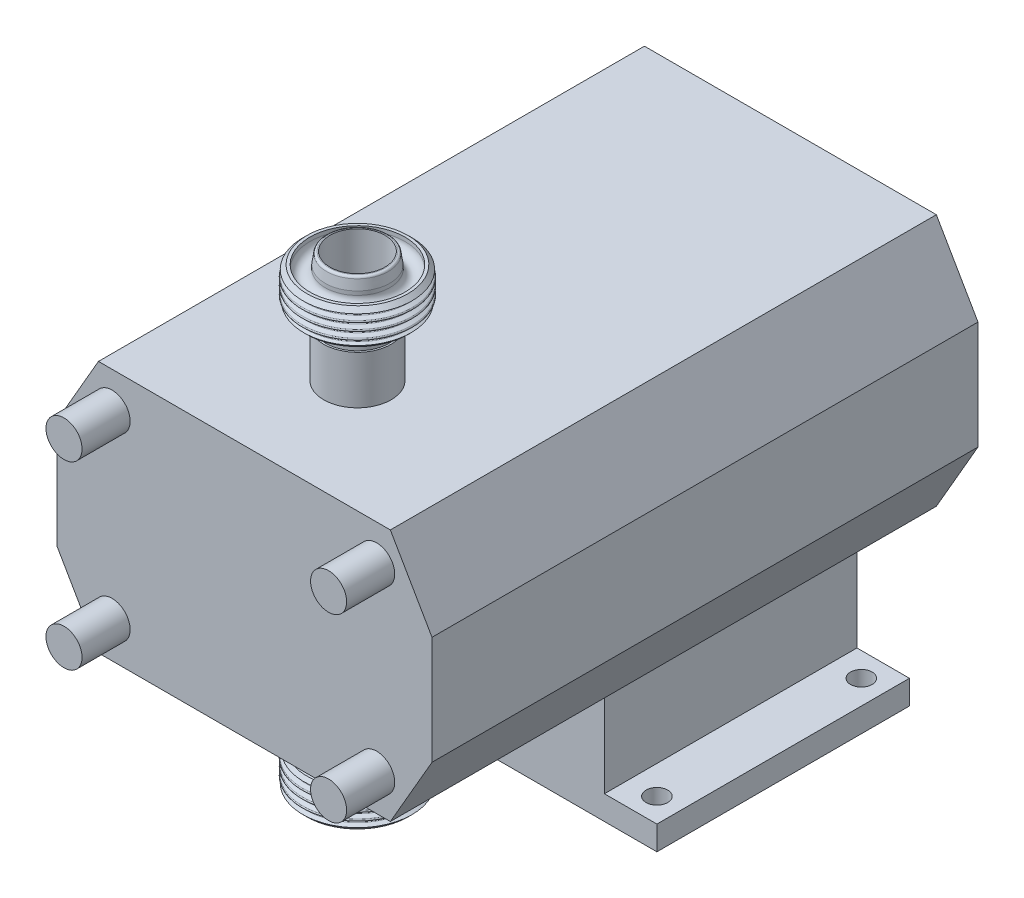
ISO-10303-21;
HEADER;
FILE_DESCRIPTION(('STEP AP214'),'2;1');
FILE_NAME('part.step','',(''),(''),'','','');
FILE_SCHEMA(('AUTOMOTIVE_DESIGN { 1 0 10303 214 1 1 1 1 }'));
ENDSEC;
DATA;
#1=APPLICATION_CONTEXT('core data for automotive mechanical design processes');
#2=APPLICATION_PROTOCOL_DEFINITION('international standard','automotive_design',2000,#1);
#3=PRODUCT_CONTEXT('',#1,'mechanical');
#4=PRODUCT('Part','Part','',(#3));
#5=PRODUCT_RELATED_PRODUCT_CATEGORY('part','',(#4));
#6=PRODUCT_DEFINITION_FORMATION('','',#4);
#7=PRODUCT_DEFINITION_CONTEXT('part definition',#1,'design');
#8=PRODUCT_DEFINITION('design','',#6,#7);
#9=PRODUCT_DEFINITION_SHAPE('','',#8);
#10=(LENGTH_UNIT() NAMED_UNIT(*) SI_UNIT(.MILLI.,.METRE.));
#11=(NAMED_UNIT(*) PLANE_ANGLE_UNIT() SI_UNIT($,.RADIAN.));
#12=(NAMED_UNIT(*) SI_UNIT($,.STERADIAN.) SOLID_ANGLE_UNIT());
#13=UNCERTAINTY_MEASURE_WITH_UNIT(LENGTH_MEASURE(1.E-05),#10,'distance_accuracy_value','');
#14=(GEOMETRIC_REPRESENTATION_CONTEXT(3) GLOBAL_UNCERTAINTY_ASSIGNED_CONTEXT((#13)) GLOBAL_UNIT_ASSIGNED_CONTEXT((#10,
#11,#12)) REPRESENTATION_CONTEXT('',''));
#15=CARTESIAN_POINT('',(0.,0.,0.));
#16=DIRECTION('',(0.,0.,1.));
#17=DIRECTION('',(1.,0.,0.));
#18=AXIS2_PLACEMENT_3D('',#15,#16,#17);
#19=CARTESIAN_POINT('',(-1.25945837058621,112.626198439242,77.5));
#20=DIRECTION('',(0.,-1.,0.));
#21=DIRECTION('',(0.897569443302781,0.,0.440873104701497));
#22=AXIS2_PLACEMENT_3D('',#19,#20,#21);
#23=CONICAL_SURFACE('',#22,21.,0.785398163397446);
#24=CARTESIAN_POINT('',(-1.25945837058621,112.626198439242,77.5));
#25=DIRECTION('',(0.,1.,0.));
#26=DIRECTION('',(-0.897569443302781,0.,-0.440873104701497));
#27=AXIS2_PLACEMENT_3D('',#24,#25,#26);
#28=CIRCLE('',#27,21.);
#29=CARTESIAN_POINT('',(-20.1084166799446,112.626198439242,68.2416648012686));
#30=VERTEX_POINT('',#29);
#31=EDGE_CURVE('P0_E53',#30,#30,#28,.T.);
#32=ORIENTED_EDGE('',*,*,#31,.F.);
#33=EDGE_LOOP('',(#32));
#34=FACE_BOUND('',#33,.T.);
#35=CARTESIAN_POINT('',(-1.25945837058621,110.920778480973,77.5));
#36=DIRECTION('',(0.,1.,0.));
#37=DIRECTION('',(-0.897569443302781,0.,-0.440873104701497));
#38=AXIS2_PLACEMENT_3D('',#35,#36,#37);
#39=CIRCLE('',#38,22.7054199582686);
#40=CARTESIAN_POINT('',(-21.6391495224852,110.920778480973,67.4897910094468));
#41=VERTEX_POINT('',#40);
#42=EDGE_CURVE('P0_E19',#41,#41,#39,.T.);
#43=ORIENTED_EDGE('',*,*,#42,.T.);
#44=EDGE_LOOP('',(#43));
#45=FACE_BOUND('',#44,.T.);
#46=ADVANCED_FACE('P0_F15',(#34,#45),#23,.T.);
#47=CARTESIAN_POINT('',(-1.25945837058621,99.9261984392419,77.5));
#48=DIRECTION('',(0.,1.,0.));
#49=DIRECTION('',(-0.897569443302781,0.,-0.440873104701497));
#50=AXIS2_PLACEMENT_3D('',#47,#48,#49);
#51=CONICAL_SURFACE('',#50,23.,0.785398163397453);
#52=CARTESIAN_POINT('',(-1.25945837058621,97.9261984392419,77.5));
#53=DIRECTION('',(0.,1.,0.));
#54=DIRECTION('',(-0.897569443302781,0.,-0.440873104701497));
#55=AXIS2_PLACEMENT_3D('',#52,#53,#54);
#56=CIRCLE('',#55,21.);
#57=CARTESIAN_POINT('',(-20.1084166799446,97.9261984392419,68.2416648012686));
#58=VERTEX_POINT('',#57);
#59=EDGE_CURVE('P0_E50',#58,#58,#56,.T.);
#60=ORIENTED_EDGE('',*,*,#59,.T.);
#61=EDGE_LOOP('',(#60));
#62=FACE_BOUND('',#61,.T.);
#63=CARTESIAN_POINT('',(-1.25945837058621,99.2534699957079,77.5));
#64=DIRECTION('',(0.,-1.,0.));
#65=DIRECTION('',(0.897569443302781,0.,0.440873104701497));
#66=AXIS2_PLACEMENT_3D('',#63,#64,#65);
#67=CIRCLE('',#66,22.327271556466);
#68=CARTESIAN_POINT('',(18.7808183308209,99.2534699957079,87.3434935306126));
#69=VERTEX_POINT('',#68);
#70=EDGE_CURVE('P0_E31',#69,#69,#67,.T.);
#71=ORIENTED_EDGE('',*,*,#70,.T.);
#72=EDGE_LOOP('',(#71));
#73=FACE_BOUND('',#72,.T.);
#74=ADVANCED_FACE('P0_F98',(#62,#73),#51,.T.);
#75=CARTESIAN_POINT('',(-1.25945837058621,95.4261984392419,77.5));
#76=DIRECTION('',(0.,1.,0.));
#77=DIRECTION('',(-0.897569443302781,0.,-0.440873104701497));
#78=AXIS2_PLACEMENT_3D('',#75,#76,#77);
#79=TOROIDAL_SURFACE('',#78,15.75,2.5);
#80=CARTESIAN_POINT('',(-1.25945837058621,95.4261984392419,77.5));
#81=DIRECTION('',(0.,1.,0.));
#82=DIRECTION('',(-0.897569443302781,0.,-0.440873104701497));
#83=AXIS2_PLACEMENT_3D('',#80,#81,#82);
#84=CIRCLE('',#83,13.25);
#85=CARTESIAN_POINT('',(-13.152253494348,95.4261984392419,71.6584313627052));
#86=VERTEX_POINT('',#85);
#87=EDGE_CURVE('P0_E10',#86,#86,#84,.T.);
#88=ORIENTED_EDGE('',*,*,#87,.T.);
#89=EDGE_LOOP('',(#88));
#90=FACE_BOUND('',#89,.T.);
#91=CARTESIAN_POINT('',(-1.25945837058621,97.9261984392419,77.5));
#92=DIRECTION('',(0.,1.,0.));
#93=DIRECTION('',(-0.897569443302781,0.,-0.440873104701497));
#94=AXIS2_PLACEMENT_3D('',#91,#92,#93);
#95=CIRCLE('',#94,15.75);
#96=CARTESIAN_POINT('',(-15.396177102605,97.9261984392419,70.5562486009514));
#97=VERTEX_POINT('',#96);
#98=EDGE_CURVE('P0_E37',#97,#97,#95,.T.);
#99=ORIENTED_EDGE('',*,*,#98,.F.);
#100=EDGE_LOOP('',(#99));
#101=FACE_BOUND('',#100,.T.);
#102=ADVANCED_FACE('P0_F17',(#90,#101),#79,.F.);
#103=CARTESIAN_POINT('',(-1.25945837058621,128.647428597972,77.5));
#104=DIRECTION('',(0.,1.,0.));
#105=DIRECTION('',(-0.897569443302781,0.,-0.440873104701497));
#106=AXIS2_PLACEMENT_3D('',#103,#104,#105);
#107=CYLINDRICAL_SURFACE('',#106,13.25);
#108=CARTESIAN_POINT('',(-1.25945837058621,90.9261984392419,77.5));
#109=DIRECTION('',(0.,1.,0.));
#110=DIRECTION('',(-0.897569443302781,0.,-0.440873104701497));
#111=AXIS2_PLACEMENT_3D('',#108,#109,#110);
#112=CIRCLE('',#111,13.25);
#113=CARTESIAN_POINT('',(-13.152253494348,90.9261984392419,71.6584313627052));
#114=VERTEX_POINT('',#113);
#115=EDGE_CURVE('P0_E23',#114,#114,#112,.T.);
#116=ORIENTED_EDGE('',*,*,#115,.T.);
#117=EDGE_LOOP('',(#116));
#118=FACE_BOUND('',#117,.T.);
#119=ORIENTED_EDGE('',*,*,#87,.F.);
#120=EDGE_LOOP('',(#119));
#121=FACE_BOUND('',#120,.T.);
#122=ADVANCED_FACE('P0_F95',(#118,#121),#107,.T.);
#123=CARTESIAN_POINT('',(3.78853867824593,90.9261984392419,67.2228298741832));
#124=DIRECTION('',(0.,-1.,0.));
#125=DIRECTION('',(0.897569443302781,0.,0.440873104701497));
#126=AXIS2_PLACEMENT_3D('',#123,#124,#125);
#127=PLANE('',#126);
#128=CARTESIAN_POINT('',(-1.25945837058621,90.9261984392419,77.5));
#129=DIRECTION('',(0.,1.,0.));
#130=DIRECTION('',(-0.897569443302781,0.,-0.440873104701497));
#131=AXIS2_PLACEMENT_3D('',#128,#129,#130);
#132=CIRCLE('',#131,11.45);
#133=CARTESIAN_POINT('',(-11.536628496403,90.9261984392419,72.4520029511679));
#134=VERTEX_POINT('',#133);
#135=EDGE_CURVE('P0_E28',#134,#134,#132,.T.);
#136=ORIENTED_EDGE('',*,*,#135,.T.);
#137=EDGE_LOOP('',(#136));
#138=FACE_BOUND('',#137,.T.);
#139=ORIENTED_EDGE('',*,*,#115,.F.);
#140=EDGE_LOOP('',(#139));
#141=FACE_BOUND('',#140,.T.);
#142=ADVANCED_FACE('P0_F79',(#138,#141),#127,.T.);
#143=CARTESIAN_POINT('',(-1.25945837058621,128.647428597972,77.5));
#144=DIRECTION('',(0.,1.,0.));
#145=DIRECTION('',(-0.897569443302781,0.,-0.440873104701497));
#146=AXIS2_PLACEMENT_3D('',#143,#144,#145);
#147=CYLINDRICAL_SURFACE('',#146,11.45);
#148=CARTESIAN_POINT('',(-1.25945837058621,117.426198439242,77.5));
#149=DIRECTION('',(0.,1.,0.));
#150=DIRECTION('',(-0.897569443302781,0.,-0.440873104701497));
#151=AXIS2_PLACEMENT_3D('',#148,#149,#150);
#152=CIRCLE('',#151,11.45);
#153=CARTESIAN_POINT('',(-11.536628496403,117.426198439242,72.4520029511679));
#154=VERTEX_POINT('',#153);
#155=EDGE_CURVE('P0_E74',#154,#154,#152,.T.);
#156=ORIENTED_EDGE('',*,*,#155,.T.);
#157=EDGE_LOOP('',(#156));
#158=FACE_BOUND('',#157,.T.);
#159=ORIENTED_EDGE('',*,*,#135,.F.);
#160=EDGE_LOOP('',(#159));
#161=FACE_BOUND('',#160,.T.);
#162=ADVANCED_FACE('P0_F82',(#158,#161),#147,.F.);
#163=CARTESIAN_POINT('',(3.97413746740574,117.426198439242,66.8449710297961));
#164=DIRECTION('',(0.,1.,0.));
#165=DIRECTION('',(-0.897569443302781,0.,-0.440873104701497));
#166=AXIS2_PLACEMENT_3D('',#163,#164,#165);
#167=PLANE('',#166);
#168=CARTESIAN_POINT('',(-1.25945837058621,117.426198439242,77.5));
#169=DIRECTION('',(0.,1.,0.));
#170=DIRECTION('',(-0.897569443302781,0.,-0.440873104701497));
#171=AXIS2_PLACEMENT_3D('',#168,#169,#170);
#172=CIRCLE('',#171,11.8709800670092);
#173=CARTESIAN_POINT('',(-11.9144873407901,117.426198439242,72.2664041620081));
#174=VERTEX_POINT('',#173);
#175=EDGE_CURVE('P0_E71',#174,#174,#172,.T.);
#176=ORIENTED_EDGE('',*,*,#175,.T.);
#177=EDGE_LOOP('',(#176));
#178=FACE_BOUND('',#177,.T.);
#179=ORIENTED_EDGE('',*,*,#155,.F.);
#180=EDGE_LOOP('',(#179));
#181=FACE_BOUND('',#180,.T.);
#182=ADVANCED_FACE('P0_F84',(#178,#181),#167,.T.);
#183=CARTESIAN_POINT('',(-1.25945837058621,116.426198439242,77.5));
#184=DIRECTION('',(0.,1.,0.));
#185=DIRECTION('',(-0.897569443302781,0.,-0.440873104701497));
#186=AXIS2_PLACEMENT_3D('',#183,#184,#185);
#187=TOROIDAL_SURFACE('',#186,11.8709800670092,1.);
#188=CARTESIAN_POINT('',(-1.25945837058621,116.574007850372,77.5));
#189=DIRECTION('',(0.,1.,0.));
#190=DIRECTION('',(-0.897569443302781,0.,-0.440873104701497));
#191=AXIS2_PLACEMENT_3D('',#188,#189,#190);
#192=CIRCLE('',#191,12.8599959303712);
#193=CARTESIAN_POINT('',(-12.8021977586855,116.574007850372,71.8303736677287));
#194=VERTEX_POINT('',#193);
#195=EDGE_CURVE('P0_E68',#194,#194,#192,.T.);
#196=ORIENTED_EDGE('',*,*,#195,.T.);
#197=EDGE_LOOP('',(#196));
#198=FACE_BOUND('',#197,.T.);
#199=ORIENTED_EDGE('',*,*,#175,.F.);
#200=EDGE_LOOP('',(#199));
#201=FACE_BOUND('',#200,.T.);
#202=ADVANCED_FACE('P0_F92',(#198,#201),#187,.T.);
#203=CARTESIAN_POINT('',(-1.25945837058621,116.574007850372,77.5));
#204=DIRECTION('',(0.,-1.,0.));
#205=DIRECTION('',(0.897569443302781,0.,0.440873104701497));
#206=AXIS2_PLACEMENT_3D('',#203,#204,#205);
#207=CONICAL_SURFACE('',#206,12.8599959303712,0.148352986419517);
#208=CARTESIAN_POINT('',(-1.25945837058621,112.626198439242,77.5));
#209=DIRECTION('',(0.,1.,0.));
#210=DIRECTION('',(-0.897569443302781,0.,-0.440873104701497));
#211=AXIS2_PLACEMENT_3D('',#208,#209,#210);
#212=CIRCLE('',#211,13.45);
#213=CARTESIAN_POINT('',(-13.3317673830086,112.626198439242,71.5702567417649));
#214=VERTEX_POINT('',#213);
#215=EDGE_CURVE('P0_E65',#214,#214,#212,.T.);
#216=ORIENTED_EDGE('',*,*,#215,.T.);
#217=EDGE_LOOP('',(#216));
#218=FACE_BOUND('',#217,.T.);
#219=ORIENTED_EDGE('',*,*,#195,.F.);
#220=EDGE_LOOP('',(#219));
#221=FACE_BOUND('',#220,.T.);
#222=ADVANCED_FACE('P0_F126',(#218,#221),#207,.T.);
#223=CARTESIAN_POINT('',(-1.25945837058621,128.647428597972,77.5));
#224=DIRECTION('',(0.,1.,0.));
#225=DIRECTION('',(-0.897569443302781,0.,-0.440873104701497));
#226=AXIS2_PLACEMENT_3D('',#223,#224,#225);
#227=CYLINDRICAL_SURFACE('',#226,13.45);
#228=CARTESIAN_POINT('',(-1.25945837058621,111.026198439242,77.5));
#229=DIRECTION('',(0.,1.,0.));
#230=DIRECTION('',(-0.897569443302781,0.,-0.440873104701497));
#231=AXIS2_PLACEMENT_3D('',#228,#229,#230);
#232=CIRCLE('',#231,13.45);
#233=CARTESIAN_POINT('',(-13.3317673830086,111.026198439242,71.5702567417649));
#234=VERTEX_POINT('',#233);
#235=EDGE_CURVE('P0_E62',#234,#234,#232,.T.);
#236=ORIENTED_EDGE('',*,*,#235,.T.);
#237=EDGE_LOOP('',(#236));
#238=FACE_BOUND('',#237,.T.);
#239=ORIENTED_EDGE('',*,*,#215,.F.);
#240=EDGE_LOOP('',(#239));
#241=FACE_BOUND('',#240,.T.);
#242=ADVANCED_FACE('P0_F122',(#238,#241),#227,.T.);
#243=CARTESIAN_POINT('',(-1.25945837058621,111.026198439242,77.5));
#244=DIRECTION('',(0.,1.,0.));
#245=DIRECTION('',(-0.897569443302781,0.,-0.440873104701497));
#246=AXIS2_PLACEMENT_3D('',#243,#244,#245);
#247=TOROIDAL_SURFACE('',#246,16.625,3.175);
#248=CARTESIAN_POINT('',(-1.25945837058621,111.026198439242,77.5));
#249=DIRECTION('',(0.,1.,0.));
#250=DIRECTION('',(-0.897569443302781,0.,-0.440873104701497));
#251=AXIS2_PLACEMENT_3D('',#248,#249,#250);
#252=CIRCLE('',#251,19.8);
#253=CARTESIAN_POINT('',(-19.0313333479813,111.026198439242,68.7707125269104));
#254=VERTEX_POINT('',#253);
#255=EDGE_CURVE('P0_E59',#254,#254,#252,.T.);
#256=ORIENTED_EDGE('',*,*,#255,.T.);
#257=EDGE_LOOP('',(#256));
#258=FACE_BOUND('',#257,.T.);
#259=ORIENTED_EDGE('',*,*,#235,.F.);
#260=EDGE_LOOP('',(#259));
#261=FACE_BOUND('',#260,.T.);
#262=ADVANCED_FACE('P0_F118',(#258,#261),#247,.F.);
#263=CARTESIAN_POINT('',(-1.25945837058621,128.647428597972,77.5));
#264=DIRECTION('',(0.,1.,0.));
#265=DIRECTION('',(-0.897569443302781,0.,-0.440873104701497));
#266=AXIS2_PLACEMENT_3D('',#263,#264,#265);
#267=CYLINDRICAL_SURFACE('',#266,19.8);
#268=CARTESIAN_POINT('',(-1.25945837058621,112.626198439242,77.5));
#269=DIRECTION('',(0.,1.,0.));
#270=DIRECTION('',(-0.897569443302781,0.,-0.440873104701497));
#271=AXIS2_PLACEMENT_3D('',#268,#269,#270);
#272=CIRCLE('',#271,19.8);
#273=CARTESIAN_POINT('',(-19.0313333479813,112.626198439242,68.7707125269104));
#274=VERTEX_POINT('',#273);
#275=EDGE_CURVE('P0_E56',#274,#274,#272,.T.);
#276=ORIENTED_EDGE('',*,*,#275,.T.);
#277=EDGE_LOOP('',(#276));
#278=FACE_BOUND('',#277,.T.);
#279=ORIENTED_EDGE('',*,*,#255,.F.);
#280=EDGE_LOOP('',(#279));
#281=FACE_BOUND('',#280,.T.);
#282=ADVANCED_FACE('P0_F114',(#278,#281),#267,.F.);
#283=CARTESIAN_POINT('',(7.99887682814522,112.626198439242,58.6510416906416));
#284=DIRECTION('',(0.,1.,0.));
#285=DIRECTION('',(-0.897569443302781,0.,-0.440873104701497));
#286=AXIS2_PLACEMENT_3D('',#283,#284,#285);
#287=PLANE('',#286);
#288=ORIENTED_EDGE('',*,*,#31,.T.);
#289=EDGE_LOOP('',(#288));
#290=FACE_BOUND('',#289,.T.);
#291=ORIENTED_EDGE('',*,*,#275,.F.);
#292=EDGE_LOOP('',(#291));
#293=FACE_BOUND('',#292,.T.);
#294=ADVANCED_FACE('P0_F110',(#290,#293),#287,.T.);
#295=CARTESIAN_POINT('',(5.68429302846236,97.9261984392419,63.3632812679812));
#296=DIRECTION('',(0.,-1.,0.));
#297=DIRECTION('',(0.897569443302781,0.,0.440873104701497));
#298=AXIS2_PLACEMENT_3D('',#295,#296,#297);
#299=PLANE('',#298);
#300=ORIENTED_EDGE('',*,*,#98,.T.);
#301=EDGE_LOOP('',(#300));
#302=FACE_BOUND('',#301,.T.);
#303=ORIENTED_EDGE('',*,*,#59,.F.);
#304=EDGE_LOOP('',(#303));
#305=FACE_BOUND('',#304,.T.);
#306=ADVANCED_FACE('P0_F113',(#302,#305),#299,.T.);
#307=CARTESIAN_POINT('',(-1.25945837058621,108.163698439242,77.5));
#308=DIRECTION('',(0.,1.,0.));
#309=DIRECTION('',(-0.897569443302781,0.,-0.440873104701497));
#310=AXIS2_PLACEMENT_3D('',#307,#308,#309);
#311=TOROIDAL_SURFACE('',#310,22.564,0.435999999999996);
#312=CARTESIAN_POINT('',(-1.25945837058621,108.550435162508,77.5));
#313=DIRECTION('',(0.,1.,0.));
#314=DIRECTION('',(-0.897569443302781,0.,-0.440873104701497));
#315=AXIS2_PLACEMENT_3D('',#312,#313,#314);
#316=CIRCLE('',#315,22.7653223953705);
#317=CARTESIAN_POINT('',(-21.6929161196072,108.550435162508,67.4633816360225));
#318=VERTEX_POINT('',#317);
#319=EDGE_CURVE('P0_E44',#318,#318,#316,.T.);
#320=ORIENTED_EDGE('',*,*,#319,.F.);
#321=EDGE_LOOP('',(#320));
#322=FACE_BOUND('',#321,.T.);
#323=CARTESIAN_POINT('',(-1.25945837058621,107.776961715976,77.5));
#324=DIRECTION('',(0.,1.,0.));
#325=DIRECTION('',(-0.897569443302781,0.,-0.440873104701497));
#326=AXIS2_PLACEMENT_3D('',#323,#324,#325);
#327=CIRCLE('',#326,22.7653223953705);
#328=CARTESIAN_POINT('',(-21.6929161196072,107.776961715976,67.4633816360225));
#329=VERTEX_POINT('',#328);
#330=EDGE_CURVE('P0_E329',#329,#329,#327,.T.);
#331=ORIENTED_EDGE('',*,*,#330,.T.);
#332=EDGE_LOOP('',(#331));
#333=FACE_BOUND('',#332,.T.);
#334=ADVANCED_FACE('P0_F172',(#322,#333),#311,.T.);
#335=CARTESIAN_POINT('',(-1.25945837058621,104.988698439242,77.5));
#336=DIRECTION('',(0.,1.,0.));
#337=DIRECTION('',(-0.897569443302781,0.,-0.440873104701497));
#338=AXIS2_PLACEMENT_3D('',#335,#336,#337);
#339=TOROIDAL_SURFACE('',#338,22.564,0.435999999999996);
#340=CARTESIAN_POINT('',(-1.25945837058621,105.375435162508,77.5));
#341=DIRECTION('',(0.,1.,0.));
#342=DIRECTION('',(-0.897569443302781,0.,-0.440873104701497));
#343=AXIS2_PLACEMENT_3D('',#340,#341,#342);
#344=CIRCLE('',#343,22.7653223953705);
#345=CARTESIAN_POINT('',(-21.6929161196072,105.375435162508,67.4633816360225));
#346=VERTEX_POINT('',#345);
#347=EDGE_CURVE('P0_E320',#346,#346,#344,.T.);
#348=ORIENTED_EDGE('',*,*,#347,.F.);
#349=EDGE_LOOP('',(#348));
#350=FACE_BOUND('',#349,.T.);
#351=CARTESIAN_POINT('',(-1.25945837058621,104.601961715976,77.5));
#352=DIRECTION('',(0.,1.,0.));
#353=DIRECTION('',(-0.897569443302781,0.,-0.440873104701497));
#354=AXIS2_PLACEMENT_3D('',#351,#352,#353);
#355=CIRCLE('',#354,22.7653223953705);
#356=CARTESIAN_POINT('',(-21.6929161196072,104.601961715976,67.4633816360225));
#357=VERTEX_POINT('',#356);
#358=EDGE_CURVE('P0_E317',#357,#357,#355,.T.);
#359=ORIENTED_EDGE('',*,*,#358,.T.);
#360=EDGE_LOOP('',(#359));
#361=FACE_BOUND('',#360,.T.);
#362=ADVANCED_FACE('P0_F179',(#350,#361),#339,.T.);
#363=CARTESIAN_POINT('',(-1.25945837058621,101.813698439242,77.5));
#364=DIRECTION('',(0.,1.,0.));
#365=DIRECTION('',(-0.897569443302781,0.,-0.440873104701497));
#366=AXIS2_PLACEMENT_3D('',#363,#364,#365);
#367=TOROIDAL_SURFACE('',#366,22.564,0.435999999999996);
#368=CARTESIAN_POINT('',(-1.25945837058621,102.200435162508,77.5));
#369=DIRECTION('',(0.,1.,0.));
#370=DIRECTION('',(-0.897569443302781,0.,-0.440873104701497));
#371=AXIS2_PLACEMENT_3D('',#368,#369,#370);
#372=CIRCLE('',#371,22.7653223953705);
#373=CARTESIAN_POINT('',(-21.6929161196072,102.200435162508,67.4633816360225));
#374=VERTEX_POINT('',#373);
#375=EDGE_CURVE('P0_E308',#374,#374,#372,.T.);
#376=ORIENTED_EDGE('',*,*,#375,.F.);
#377=EDGE_LOOP('',(#376));
#378=FACE_BOUND('',#377,.T.);
#379=CARTESIAN_POINT('',(-1.25945837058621,101.426961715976,77.5));
#380=DIRECTION('',(0.,1.,0.));
#381=DIRECTION('',(-0.897569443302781,0.,-0.440873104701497));
#382=AXIS2_PLACEMENT_3D('',#379,#380,#381);
#383=CIRCLE('',#382,22.7653223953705);
#384=CARTESIAN_POINT('',(-21.6929161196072,101.426961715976,67.4633816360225));
#385=VERTEX_POINT('',#384);
#386=EDGE_CURVE('P0_E303',#385,#385,#383,.T.);
#387=ORIENTED_EDGE('',*,*,#386,.T.);
#388=EDGE_LOOP('',(#387));
#389=FACE_BOUND('',#388,.T.);
#390=ADVANCED_FACE('P0_F187',(#378,#389),#367,.T.);
#391=CARTESIAN_POINT('',(-1.25945837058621,110.951961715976,77.5));
#392=DIRECTION('',(0.,1.,0.));
#393=DIRECTION('',(-0.897569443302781,0.,-0.440873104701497));
#394=AXIS2_PLACEMENT_3D('',#391,#392,#393);
#395=CONICAL_SURFACE('',#394,22.7653223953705,1.09083078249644);
#396=ORIENTED_EDGE('',*,*,#42,.F.);
#397=EDGE_LOOP('',(#396));
#398=FACE_BOUND('',#397,.T.);
#399=CARTESIAN_POINT('',(-1.25945837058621,110.137935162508,77.5));
#400=DIRECTION('',(0.,1.,0.));
#401=DIRECTION('',(-0.897569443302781,0.,-0.440873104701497));
#402=AXIS2_PLACEMENT_3D('',#399,#400,#401);
#403=CIRCLE('',#402,21.2015919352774);
#404=CARTESIAN_POINT('',(-20.2893594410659,110.137935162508,68.15278833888));
#405=VERTEX_POINT('',#404);
#406=EDGE_CURVE('P0_E33',#405,#405,#403,.T.);
#407=ORIENTED_EDGE('',*,*,#406,.T.);
#408=EDGE_LOOP('',(#407));
#409=FACE_BOUND('',#408,.T.);
#410=ADVANCED_FACE('P0_F195',(#398,#409),#395,.T.);
#411=CARTESIAN_POINT('',(-1.25945837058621,109.751198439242,77.5));
#412=DIRECTION('',(0.,1.,0.));
#413=DIRECTION('',(-0.897569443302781,0.,-0.440873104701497));
#414=AXIS2_PLACEMENT_3D('',#411,#412,#413);
#415=TOROIDAL_SURFACE('',#414,21.4029143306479,0.436000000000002);
#416=CARTESIAN_POINT('',(-1.25945837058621,109.364461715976,77.5));
#417=DIRECTION('',(0.,1.,0.));
#418=DIRECTION('',(-0.897569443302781,0.,-0.440873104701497));
#419=AXIS2_PLACEMENT_3D('',#416,#417,#418);
#420=CIRCLE('',#419,21.2015919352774);
#421=CARTESIAN_POINT('',(-20.2893594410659,109.364461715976,68.15278833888));
#422=VERTEX_POINT('',#421);
#423=EDGE_CURVE('P0_E39',#422,#422,#420,.T.);
#424=ORIENTED_EDGE('',*,*,#423,.T.);
#425=EDGE_LOOP('',(#424));
#426=FACE_BOUND('',#425,.T.);
#427=ORIENTED_EDGE('',*,*,#406,.F.);
#428=EDGE_LOOP('',(#427));
#429=FACE_BOUND('',#428,.T.);
#430=ADVANCED_FACE('P0_F203',(#426,#429),#415,.F.);
#431=CARTESIAN_POINT('',(-1.25945837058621,109.364461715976,77.5));
#432=DIRECTION('',(0.,-1.,0.));
#433=DIRECTION('',(0.897569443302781,0.,0.440873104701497));
#434=AXIS2_PLACEMENT_3D('',#431,#432,#433);
#435=CONICAL_SURFACE('',#434,21.2015919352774,1.09083078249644);
#436=ORIENTED_EDGE('',*,*,#319,.T.);
#437=EDGE_LOOP('',(#436));
#438=FACE_BOUND('',#437,.T.);
#439=ORIENTED_EDGE('',*,*,#423,.F.);
#440=EDGE_LOOP('',(#439));
#441=FACE_BOUND('',#440,.T.);
#442=ADVANCED_FACE('P0_F211',(#438,#441),#435,.T.);
#443=CARTESIAN_POINT('',(-1.25945837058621,107.776961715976,77.5));
#444=DIRECTION('',(0.,1.,0.));
#445=DIRECTION('',(-0.897569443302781,0.,-0.440873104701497));
#446=AXIS2_PLACEMENT_3D('',#443,#444,#445);
#447=CONICAL_SURFACE('',#446,22.7653223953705,1.09083078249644);
#448=CARTESIAN_POINT('',(-1.25945837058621,106.962935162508,77.5));
#449=DIRECTION('',(0.,1.,0.));
#450=DIRECTION('',(-0.897569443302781,0.,-0.440873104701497));
#451=AXIS2_PLACEMENT_3D('',#448,#449,#450);
#452=CIRCLE('',#451,21.2015919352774);
#453=CARTESIAN_POINT('',(-20.2893594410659,106.962935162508,68.15278833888));
#454=VERTEX_POINT('',#453);
#455=EDGE_CURVE('P0_E326',#454,#454,#452,.T.);
#456=ORIENTED_EDGE('',*,*,#455,.T.);
#457=EDGE_LOOP('',(#456));
#458=FACE_BOUND('',#457,.T.);
#459=ORIENTED_EDGE('',*,*,#330,.F.);
#460=EDGE_LOOP('',(#459));
#461=FACE_BOUND('',#460,.T.);
#462=ADVANCED_FACE('P0_F219',(#458,#461),#447,.T.);
#463=CARTESIAN_POINT('',(-1.25945837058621,106.576198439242,77.5));
#464=DIRECTION('',(0.,1.,0.));
#465=DIRECTION('',(-0.897569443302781,0.,-0.440873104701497));
#466=AXIS2_PLACEMENT_3D('',#463,#464,#465);
#467=TOROIDAL_SURFACE('',#466,21.4029143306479,0.436000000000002);
#468=CARTESIAN_POINT('',(-1.25945837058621,106.189461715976,77.5));
#469=DIRECTION('',(0.,1.,0.));
#470=DIRECTION('',(-0.897569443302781,0.,-0.440873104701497));
#471=AXIS2_PLACEMENT_3D('',#468,#469,#470);
#472=CIRCLE('',#471,21.2015919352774);
#473=CARTESIAN_POINT('',(-20.2893594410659,106.189461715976,68.15278833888));
#474=VERTEX_POINT('',#473);
#475=EDGE_CURVE('P0_E323',#474,#474,#472,.T.);
#476=ORIENTED_EDGE('',*,*,#475,.T.);
#477=EDGE_LOOP('',(#476));
#478=FACE_BOUND('',#477,.T.);
#479=ORIENTED_EDGE('',*,*,#455,.F.);
#480=EDGE_LOOP('',(#479));
#481=FACE_BOUND('',#480,.T.);
#482=ADVANCED_FACE('P0_F227',(#478,#481),#467,.F.);
#483=CARTESIAN_POINT('',(-1.25945837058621,106.189461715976,77.5));
#484=DIRECTION('',(0.,-1.,0.));
#485=DIRECTION('',(0.897569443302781,0.,0.440873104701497));
#486=AXIS2_PLACEMENT_3D('',#483,#484,#485);
#487=CONICAL_SURFACE('',#486,21.2015919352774,1.09083078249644);
#488=ORIENTED_EDGE('',*,*,#347,.T.);
#489=EDGE_LOOP('',(#488));
#490=FACE_BOUND('',#489,.T.);
#491=ORIENTED_EDGE('',*,*,#475,.F.);
#492=EDGE_LOOP('',(#491));
#493=FACE_BOUND('',#492,.T.);
#494=ADVANCED_FACE('P0_F235',(#490,#493),#487,.T.);
#495=CARTESIAN_POINT('',(-1.25945837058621,104.601961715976,77.5));
#496=DIRECTION('',(0.,1.,0.));
#497=DIRECTION('',(-0.897569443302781,0.,-0.440873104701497));
#498=AXIS2_PLACEMENT_3D('',#495,#496,#497);
#499=CONICAL_SURFACE('',#498,22.7653223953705,1.09083078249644);
#500=CARTESIAN_POINT('',(-1.25945837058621,103.787935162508,77.5));
#501=DIRECTION('',(0.,1.,0.));
#502=DIRECTION('',(-0.897569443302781,0.,-0.440873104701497));
#503=AXIS2_PLACEMENT_3D('',#500,#501,#502);
#504=CIRCLE('',#503,21.2015919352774);
#505=CARTESIAN_POINT('',(-20.2893594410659,103.787935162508,68.15278833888));
#506=VERTEX_POINT('',#505);
#507=EDGE_CURVE('P0_E314',#506,#506,#504,.T.);
#508=ORIENTED_EDGE('',*,*,#507,.T.);
#509=EDGE_LOOP('',(#508));
#510=FACE_BOUND('',#509,.T.);
#511=ORIENTED_EDGE('',*,*,#358,.F.);
#512=EDGE_LOOP('',(#511));
#513=FACE_BOUND('',#512,.T.);
#514=ADVANCED_FACE('P0_F243',(#510,#513),#499,.T.);
#515=CARTESIAN_POINT('',(-1.25945837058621,103.401198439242,77.5));
#516=DIRECTION('',(0.,1.,0.));
#517=DIRECTION('',(-0.897569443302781,0.,-0.440873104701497));
#518=AXIS2_PLACEMENT_3D('',#515,#516,#517);
#519=TOROIDAL_SURFACE('',#518,21.4029143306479,0.436000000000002);
#520=CARTESIAN_POINT('',(-1.25945837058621,103.014461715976,77.5));
#521=DIRECTION('',(0.,1.,0.));
#522=DIRECTION('',(-0.897569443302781,0.,-0.440873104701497));
#523=AXIS2_PLACEMENT_3D('',#520,#521,#522);
#524=CIRCLE('',#523,21.2015919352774);
#525=CARTESIAN_POINT('',(-20.2893594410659,103.014461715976,68.15278833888));
#526=VERTEX_POINT('',#525);
#527=EDGE_CURVE('P0_E311',#526,#526,#524,.T.);
#528=ORIENTED_EDGE('',*,*,#527,.T.);
#529=EDGE_LOOP('',(#528));
#530=FACE_BOUND('',#529,.T.);
#531=ORIENTED_EDGE('',*,*,#507,.F.);
#532=EDGE_LOOP('',(#531));
#533=FACE_BOUND('',#532,.T.);
#534=ADVANCED_FACE('P0_F251',(#530,#533),#519,.F.);
#535=CARTESIAN_POINT('',(-1.25945837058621,103.014461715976,77.5));
#536=DIRECTION('',(0.,-1.,0.));
#537=DIRECTION('',(0.897569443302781,0.,0.440873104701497));
#538=AXIS2_PLACEMENT_3D('',#535,#536,#537);
#539=CONICAL_SURFACE('',#538,21.2015919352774,1.09083078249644);
#540=ORIENTED_EDGE('',*,*,#375,.T.);
#541=EDGE_LOOP('',(#540));
#542=FACE_BOUND('',#541,.T.);
#543=ORIENTED_EDGE('',*,*,#527,.F.);
#544=EDGE_LOOP('',(#543));
#545=FACE_BOUND('',#544,.T.);
#546=ADVANCED_FACE('P0_F259',(#542,#545),#539,.T.);
#547=CARTESIAN_POINT('',(-1.25945837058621,101.426961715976,77.5));
#548=DIRECTION('',(0.,1.,0.));
#549=DIRECTION('',(-0.897569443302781,0.,-0.440873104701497));
#550=AXIS2_PLACEMENT_3D('',#547,#548,#549);
#551=CONICAL_SURFACE('',#550,22.7653223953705,1.09083078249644);
#552=CARTESIAN_POINT('',(-1.25945837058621,100.612935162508,77.5));
#553=DIRECTION('',(0.,1.,0.));
#554=DIRECTION('',(-0.897569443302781,0.,-0.440873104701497));
#555=AXIS2_PLACEMENT_3D('',#552,#553,#554);
#556=CIRCLE('',#555,21.2015919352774);
#557=CARTESIAN_POINT('',(-20.2893594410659,100.612935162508,68.15278833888));
#558=VERTEX_POINT('',#557);
#559=EDGE_CURVE('P0_E300',#558,#558,#556,.T.);
#560=ORIENTED_EDGE('',*,*,#559,.T.);
#561=EDGE_LOOP('',(#560));
#562=FACE_BOUND('',#561,.T.);
#563=ORIENTED_EDGE('',*,*,#386,.F.);
#564=EDGE_LOOP('',(#563));
#565=FACE_BOUND('',#564,.T.);
#566=ADVANCED_FACE('P0_F267',(#562,#565),#551,.T.);
#567=CARTESIAN_POINT('',(-1.25945837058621,100.226198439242,77.5));
#568=DIRECTION('',(0.,1.,0.));
#569=DIRECTION('',(-0.897569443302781,0.,-0.440873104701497));
#570=AXIS2_PLACEMENT_3D('',#567,#568,#569);
#571=TOROIDAL_SURFACE('',#570,21.4029143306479,0.436000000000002);
#572=CARTESIAN_POINT('',(-1.25945837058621,99.8394617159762,77.5));
#573=DIRECTION('',(0.,1.,0.));
#574=DIRECTION('',(-0.897569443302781,0.,-0.440873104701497));
#575=AXIS2_PLACEMENT_3D('',#572,#573,#574);
#576=CIRCLE('',#575,21.2015919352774);
#577=CARTESIAN_POINT('',(-20.2893594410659,99.8394617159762,68.15278833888));
#578=VERTEX_POINT('',#577);
#579=EDGE_CURVE('P0_E299',#578,#578,#576,.T.);
#580=ORIENTED_EDGE('',*,*,#579,.T.);
#581=EDGE_LOOP('',(#580));
#582=FACE_BOUND('',#581,.T.);
#583=ORIENTED_EDGE('',*,*,#559,.F.);
#584=EDGE_LOOP('',(#583));
#585=FACE_BOUND('',#584,.T.);
#586=ADVANCED_FACE('P0_F275',(#582,#585),#571,.F.);
#587=CARTESIAN_POINT('',(-1.25945837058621,99.8394617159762,77.5));
#588=DIRECTION('',(0.,-1.,0.));
#589=DIRECTION('',(0.897569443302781,0.,0.440873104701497));
#590=AXIS2_PLACEMENT_3D('',#587,#588,#589);
#591=CONICAL_SURFACE('',#590,21.2015919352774,1.09083078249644);
#592=ORIENTED_EDGE('',*,*,#70,.F.);
#593=EDGE_LOOP('',(#592));
#594=FACE_BOUND('',#593,.T.);
#595=ORIENTED_EDGE('',*,*,#579,.F.);
#596=EDGE_LOOP('',(#595));
#597=FACE_BOUND('',#596,.T.);
#598=ADVANCED_FACE('P0_F283',(#594,#597),#591,.T.);
#599=CLOSED_SHELL('',(#46,#74,#102,#122,#142,#162,#182,#202,#222,#242,#262,#282,#294,#306,#334,
#362,#390,#410,#430,#442,#462,#482,#494,#514,#534,#546,#566,#586,#598));
#600=MANIFOLD_SOLID_BREP('P0_B1',#599);
#601=CARTESIAN_POINT('',(-26.2594583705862,18.4261984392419,139.232657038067));
#602=DIRECTION('',(0.,0.,1.));
#603=DIRECTION('',(1.,0.,0.));
#604=AXIS2_PLACEMENT_3D('',#601,#602,#603);
#605=CYLINDRICAL_SURFACE('',#604,9.5);
#606=CARTESIAN_POINT('',(-26.2594583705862,18.4261984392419,-104.5));
#607=DIRECTION('',(0.,0.,1.));
#608=DIRECTION('',(1.,0.,0.));
#609=AXIS2_PLACEMENT_3D('',#606,#607,#608);
#610=CIRCLE('',#609,9.5);
#611=CARTESIAN_POINT('',(-16.7594583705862,18.4261984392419,-104.5));
#612=VERTEX_POINT('',#611);
#613=EDGE_CURVE('P1_E277',#612,#612,#610,.T.);
#614=ORIENTED_EDGE('',*,*,#613,.F.);
#615=EDGE_LOOP('',(#614));
#616=FACE_BOUND('',#615,.T.);
#617=DIRECTION('',(0.,0.,1.));
#618=VECTOR('',#617,1.);
#619=CARTESIAN_POINT('',(-17.2455801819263,21.4261984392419,139.232657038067));
#620=LINE('',#619,#618);
#621=CARTESIAN_POINT('',(-17.2455801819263,21.4261984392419,-144.5));
#622=VERTEX_POINT('',#621);
#623=CARTESIAN_POINT('',(-17.2455801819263,21.4261984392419,-124.5));
#624=VERTEX_POINT('',#623);
#625=EDGE_CURVE('P1_E178',#622,#624,#620,.T.);
#626=ORIENTED_EDGE('',*,*,#625,.F.);
#627=CARTESIAN_POINT('',(-26.2594583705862,18.4261984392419,-144.5));
#628=DIRECTION('',(0.,0.,1.));
#629=DIRECTION('',(1.,0.,0.));
#630=AXIS2_PLACEMENT_3D('',#627,#628,#629);
#631=CIRCLE('',#630,9.5);
#632=CARTESIAN_POINT('',(-17.2455801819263,15.4261984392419,-144.5));
#633=VERTEX_POINT('',#632);
#634=EDGE_CURVE('P1_E176',#622,#633,#631,.T.);
#635=ORIENTED_EDGE('',*,*,#634,.T.);
#636=DIRECTION('',(0.,0.,1.));
#637=VECTOR('',#636,1.);
#638=CARTESIAN_POINT('',(-17.2455801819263,15.4261984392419,139.232657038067));
#639=LINE('',#638,#637);
#640=CARTESIAN_POINT('',(-17.2455801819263,15.4261984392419,-124.5));
#641=VERTEX_POINT('',#640);
#642=EDGE_CURVE('P1_E39',#641,#633,#639,.F.);
#643=ORIENTED_EDGE('',*,*,#642,.F.);
#644=CARTESIAN_POINT('',(-16.7594583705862,18.4261984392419,-127.5));
#645=CARTESIAN_POINT('',(-16.7594590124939,18.5903655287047,-127.499999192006));
#646=CARTESIAN_POINT('',(-16.7637537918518,18.7545414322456,-127.486480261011));
#647=CARTESIAN_POINT('',(-16.7804654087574,19.0780866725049,-127.432907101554));
#648=CARTESIAN_POINT('',(-16.7928839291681,19.2374550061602,-127.392847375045));
#649=CARTESIAN_POINT('',(-16.8244875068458,19.5466729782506,-127.287682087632));
#650=CARTESIAN_POINT('',(-16.843661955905,19.6965371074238,-127.222615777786));
#651=CARTESIAN_POINT('',(-16.8868011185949,19.9832275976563,-127.069452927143));
#652=CARTESIAN_POINT('',(-16.9107666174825,20.1200518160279,-126.981352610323));
#653=CARTESIAN_POINT('',(-16.9617908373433,20.3810845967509,-126.781705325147));
#654=CARTESIAN_POINT('',(-16.9889180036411,20.5048253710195,-126.669564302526));
#655=CARTESIAN_POINT('',(-17.0428148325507,20.7320932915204,-126.426283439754));
#656=CARTESIAN_POINT('',(-17.0695844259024,20.8356165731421,-126.295139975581));
#657=CARTESIAN_POINT('',(-17.1204724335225,21.0220677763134,-126.013502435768));
#658=CARTESIAN_POINT('',(-17.1445065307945,21.1044076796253,-125.862602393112));
#659=CARTESIAN_POINT('',(-17.1861711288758,21.2423462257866,-125.548215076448));
#660=CARTESIAN_POINT('',(-17.203803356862,21.2979520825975,-125.384731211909));
#661=CARTESIAN_POINT('',(-17.2299511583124,21.3791257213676,-125.055102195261));
#662=CARTESIAN_POINT('',(-17.2387298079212,21.405562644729,-124.889192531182));
#663=CARTESIAN_POINT('',(-17.2469571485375,21.4303635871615,-124.55507820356));
#664=CARTESIAN_POINT('',(-17.2464083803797,21.428735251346,-124.386874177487));
#665=CARTESIAN_POINT('',(-17.2362748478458,21.3981309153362,-124.060168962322));
#666=CARTESIAN_POINT('',(-17.2270566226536,21.3702642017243,-123.901550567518));
#667=CARTESIAN_POINT('',(-17.2012189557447,21.2897743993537,-123.591366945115));
#668=CARTESIAN_POINT('',(-17.1845987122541,21.2371486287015,-123.43980248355));
#669=CARTESIAN_POINT('',(-17.1455518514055,21.107860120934,-123.145405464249));
#670=CARTESIAN_POINT('',(-17.1230426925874,21.0308521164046,-123.00273595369));
#671=CARTESIAN_POINT('',(-17.0747915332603,20.8552248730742,-122.731982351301));
#672=CARTESIAN_POINT('',(-17.04904867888,20.7565999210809,-122.603902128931));
#673=CARTESIAN_POINT('',(-16.9957646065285,20.5351128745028,-122.359697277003));
#674=CARTESIAN_POINT('',(-16.9681954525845,20.4113363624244,-122.244406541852));
#675=CARTESIAN_POINT('',(-16.9154205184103,20.1458635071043,-122.03601351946));
#676=CARTESIAN_POINT('',(-16.8902149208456,20.0041657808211,-121.942912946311));
#677=CARTESIAN_POINT('',(-16.8447327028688,19.7052409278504,-121.78096191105));
#678=CARTESIAN_POINT('',(-16.8244976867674,19.547897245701,-121.712314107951));
#679=CARTESIAN_POINT('',(-16.7915371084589,19.2231069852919,-121.602710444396));
#680=CARTESIAN_POINT('',(-16.7788092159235,19.0556635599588,-121.561745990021));
#681=CARTESIAN_POINT('',(-16.7626736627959,18.722502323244,-121.510101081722));
#682=CARTESIAN_POINT('',(-16.7589188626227,18.5569760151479,-121.498292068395));
#683=CARTESIAN_POINT('',(-16.7601236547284,18.2262870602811,-121.502106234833));
#684=CARTESIAN_POINT('',(-16.7650819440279,18.0611243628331,-121.517725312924));
#685=CARTESIAN_POINT('',(-16.7829275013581,17.7402292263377,-121.575048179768));
#686=CARTESIAN_POINT('',(-16.7956095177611,17.5843637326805,-121.616077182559));
#687=CARTESIAN_POINT('',(-16.827414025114,17.2817752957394,-121.722228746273));
#688=CARTESIAN_POINT('',(-16.8465373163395,17.1350534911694,-121.787354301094));
#689=CARTESIAN_POINT('',(-16.8898494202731,16.8508856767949,-121.941646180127));
#690=CARTESIAN_POINT('',(-16.9141516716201,16.7137582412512,-122.031366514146));
#691=CARTESIAN_POINT('',(-16.9650461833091,16.4561286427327,-122.231638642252));
#692=CARTESIAN_POINT('',(-16.9916390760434,16.3356310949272,-122.342196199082));
#693=CARTESIAN_POINT('',(-17.0454753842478,16.1096116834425,-122.586313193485));
#694=CARTESIAN_POINT('',(-17.0727014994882,16.004894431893,-122.720623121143));
#695=CARTESIAN_POINT('',(-17.1235989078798,15.8194083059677,-123.005500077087));
#696=CARTESIAN_POINT('',(-17.1472702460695,15.7386391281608,-123.156066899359));
#697=CARTESIAN_POINT('',(-17.188119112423,15.6038274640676,-123.468923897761));
#698=CARTESIAN_POINT('',(-17.2053201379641,15.5496880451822,-123.631169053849));
#699=CARTESIAN_POINT('',(-17.2311190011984,15.4696989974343,-123.963129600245));
#700=CARTESIAN_POINT('',(-17.2397202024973,15.4438383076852,-124.132842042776));
#701=CARTESIAN_POINT('',(-17.2469900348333,15.4219460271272,-124.46649385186));
#702=CARTESIAN_POINT('',(-17.2460989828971,15.4245921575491,-124.630337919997));
#703=CARTESIAN_POINT('',(-17.2355572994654,15.4564367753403,-124.955123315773));
#704=CARTESIAN_POINT('',(-17.2259070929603,15.4856339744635,-125.116064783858));
#705=CARTESIAN_POINT('',(-17.199245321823,15.5688586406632,-125.428056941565));
#706=CARTESIAN_POINT('',(-17.1823484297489,15.6225000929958,-125.579221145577));
#707=CARTESIAN_POINT('',(-17.1431285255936,15.752785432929,-125.870523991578));
#708=CARTESIAN_POINT('',(-17.1208043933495,15.8294340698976,-126.010660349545));
#709=CARTESIAN_POINT('',(-17.072136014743,16.0071276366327,-126.281973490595));
#710=CARTESIAN_POINT('',(-17.0456670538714,16.1090227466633,-126.412571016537));
#711=CARTESIAN_POINT('',(-16.9922567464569,16.3328299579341,-126.655241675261));
#712=CARTESIAN_POINT('',(-16.9653152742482,16.4547474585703,-126.767309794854));
#713=CARTESIAN_POINT('',(-16.9129095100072,16.720065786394,-126.97351384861));
#714=CARTESIAN_POINT('',(-16.8875252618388,16.8640507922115,-127.066920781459));
#715=CARTESIAN_POINT('',(-16.8421107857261,17.1664794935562,-127.228083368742));
#716=CARTESIAN_POINT('',(-16.8220785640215,17.3249177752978,-127.295848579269));
#717=CARTESIAN_POINT('',(-16.7909255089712,17.6389266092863,-127.399197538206));
#718=CARTESIAN_POINT('',(-16.7792291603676,17.793748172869,-127.436887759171));
#719=CARTESIAN_POINT('',(-16.763496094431,18.1077771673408,-127.487286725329));
#720=CARTESIAN_POINT('',(-16.7594577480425,18.2669836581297,-127.50000078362));
#721=CARTESIAN_POINT('',(-16.7594583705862,18.4261984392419,-127.5));
#722=B_SPLINE_CURVE_WITH_KNOTS('',3,(#644,#645,#646,#647,#648,#649,#650,#651,#652,#653,#654,
#655,#656,#657,#658,#659,#660,#661,#662,#663,#664,#665,#666,#667,#668,#669,#670,#671,#672,#673,
#674,#675,#676,#677,#678,#679,#680,#681,#682,#683,#684,#685,#686,#687,#688,#689,#690,#691,#692,
#693,#694,#695,#696,#697,#698,#699,#700,#701,#702,#703,#704,#705,#706,#707,#708,#709,#710,#711,
#712,#713,#714,#715,#716,#717,#718,#719,#720,#721),.UNSPECIFIED.,.T.,.F.,(4,2,2,2,2,2,2,2,2,2,2,
2,2,2,2,2,2,2,2,2,2,2,2,2,2,2,2,2,2,2,2,2,2,2,2,2,2,2,4),(0.,0.491915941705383,
0.983933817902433,1.47518254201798,1.96651184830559,2.47177433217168,2.97713330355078,
3.49529138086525,4.0133095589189,4.51543663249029,5.01742692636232,5.49910423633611,
5.98083373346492,6.46971527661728,6.95872618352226,7.47049694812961,7.98230723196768,
8.49826565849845,9.01406383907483,9.50955937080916,10.0049808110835,10.487778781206,
10.9706367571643,11.4654198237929,11.9603399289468,12.4753133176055,12.9902801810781,
13.5033584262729,14.0162359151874,14.5054301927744,14.9946007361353,15.4763007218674,
15.9581002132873,16.4590917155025,16.9602185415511,17.4781824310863,17.9959530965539,
18.4731312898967,18.9502079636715),.UNSPECIFIED.);
#723=EDGE_CURVE('P1_E11',#624,#641,#722,.T.);
#724=ORIENTED_EDGE('',*,*,#723,.F.);
#725=EDGE_LOOP('',(#626,#635,#643,#724));
#726=FACE_BOUND('',#725,.T.);
#727=ADVANCED_FACE('P1_F17',(#616,#726),#605,.T.);
#728=CARTESIAN_POINT('',(-61.9389502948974,-34.0738015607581,124.5));
#729=DIRECTION('',(0.,1.,0.));
#730=DIRECTION('',(-1.,0.,0.));
#731=AXIS2_PLACEMENT_3D('',#728,#729,#730);
#732=PLANE('',#731);
#733=CARTESIAN_POINT('',(-1.25945837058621,-34.0738015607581,77.5));
#734=DIRECTION('',(0.,1.,0.));
#735=DIRECTION('',(-1.,0.,0.));
#736=AXIS2_PLACEMENT_3D('',#733,#734,#735);
#737=CIRCLE('',#736,14.);
#738=CARTESIAN_POINT('',(-15.2594583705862,-34.0738015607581,77.5));
#739=VERTEX_POINT('',#738);
#740=EDGE_CURVE('P1_E192',#739,#739,#737,.T.);
#741=ORIENTED_EDGE('',*,*,#740,.T.);
#742=EDGE_LOOP('',(#741));
#743=FACE_BOUND('',#742,.T.);
#744=DIRECTION('',(1.,0.,0.));
#745=VECTOR('',#744,1.);
#746=CARTESIAN_POINT('',(-61.9389502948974,-34.0738015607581,-102.5));
#747=LINE('',#746,#745);
#748=CARTESIAN_POINT('',(-61.9389502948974,-34.0738015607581,-102.5));
#749=VERTEX_POINT('',#748);
#750=CARTESIAN_POINT('',(59.4200335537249,-34.0738015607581,-102.5));
#751=VERTEX_POINT('',#750);
#752=EDGE_CURVE('P1_E337',#749,#751,#747,.T.);
#753=ORIENTED_EDGE('',*,*,#752,.T.);
#754=DIRECTION('',(0.,0.,-1.));
#755=VECTOR('',#754,1.);
#756=CARTESIAN_POINT('',(59.4200335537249,-34.0738015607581,124.5));
#757=LINE('',#756,#755);
#758=CARTESIAN_POINT('',(59.4200335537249,-34.0738015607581,124.5));
#759=VERTEX_POINT('',#758);
#760=EDGE_CURVE('P1_E347',#759,#751,#757,.T.);
#761=ORIENTED_EDGE('',*,*,#760,.F.);
#762=DIRECTION('',(1.,0.,0.));
#763=VECTOR('',#762,1.);
#764=CARTESIAN_POINT('',(-61.9389502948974,-34.0738015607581,124.5));
#765=LINE('',#764,#763);
#766=CARTESIAN_POINT('',(-61.9389502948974,-34.0738015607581,124.5));
#767=VERTEX_POINT('',#766);
#768=EDGE_CURVE('P1_E320',#767,#759,#765,.T.);
#769=ORIENTED_EDGE('',*,*,#768,.F.);
#770=DIRECTION('',(0.,0.,-1.));
#771=VECTOR('',#770,1.);
#772=CARTESIAN_POINT('',(-61.9389502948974,-34.0738015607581,124.5));
#773=LINE('',#772,#771);
#774=EDGE_CURVE('P1_E350',#767,#749,#773,.T.);
#775=ORIENTED_EDGE('',*,*,#774,.T.);
#776=EDGE_LOOP('',(#753,#761,#769,#775));
#777=FACE_BOUND('',#776,.T.);
#778=DIRECTION('',(1.,0.,0.));
#779=VECTOR('',#778,1.);
#780=CARTESIAN_POINT('',(44.4200335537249,-34.0738015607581,-84.5));
#781=LINE('',#780,#779);
#782=CARTESIAN_POINT('',(-46.9389502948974,-34.0738015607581,-84.5));
#783=VERTEX_POINT('',#782);
#784=CARTESIAN_POINT('',(44.4200335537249,-34.0738015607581,-84.5));
#785=VERTEX_POINT('',#784);
#786=EDGE_CURVE('P1_E220',#783,#785,#781,.T.);
#787=ORIENTED_EDGE('',*,*,#786,.F.);
#788=DIRECTION('',(0.,0.,1.));
#789=VECTOR('',#788,1.);
#790=CARTESIAN_POINT('',(-46.9389502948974,-34.0738015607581,-84.5));
#791=LINE('',#790,#789);
#792=CARTESIAN_POINT('',(-46.9389502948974,-34.0738015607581,20.5));
#793=VERTEX_POINT('',#792);
#794=EDGE_CURVE('P1_E238',#783,#793,#791,.T.);
#795=ORIENTED_EDGE('',*,*,#794,.T.);
#796=DIRECTION('',(1.,0.,0.));
#797=VECTOR('',#796,1.);
#798=CARTESIAN_POINT('',(44.4200335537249,-34.0738015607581,20.5));
#799=LINE('',#798,#797);
#800=CARTESIAN_POINT('',(44.4200335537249,-34.0738015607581,20.5));
#801=VERTEX_POINT('',#800);
#802=EDGE_CURVE('P1_E219',#793,#801,#799,.T.);
#803=ORIENTED_EDGE('',*,*,#802,.T.);
#804=DIRECTION('',(0.,0.,1.));
#805=VECTOR('',#804,1.);
#806=CARTESIAN_POINT('',(44.4200335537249,-34.0738015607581,-84.5));
#807=LINE('',#806,#805);
#808=EDGE_CURVE('P1_E274',#785,#801,#807,.T.);
#809=ORIENTED_EDGE('',*,*,#808,.F.);
#810=EDGE_LOOP('',(#787,#795,#803,#809));
#811=FACE_BOUND('',#810,.T.);
#812=ADVANCED_FACE('P1_F392',(#743,#777,#811),#732,.F.);
#813=CARTESIAN_POINT('',(89.7309226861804,18.4261984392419,-102.5));
#814=DIRECTION('',(0.,0.,1.));
#815=DIRECTION('',(1.,0.,0.));
#816=AXIS2_PLACEMENT_3D('',#813,#814,#815);
#817=PLANE('',#816);
#818=DIRECTION('',(-0.500000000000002,0.866025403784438,0.));
#819=VECTOR('',#818,1.);
#820=CARTESIAN_POINT('',(59.4200335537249,70.9261984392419,-102.5));
#821=LINE('',#820,#819);
#822=CARTESIAN_POINT('',(76.7405416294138,40.9261984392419,-102.5));
#823=VERTEX_POINT('',#822);
#824=CARTESIAN_POINT('',(59.4200335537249,70.9261984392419,-102.5));
#825=VERTEX_POINT('',#824);
#826=EDGE_CURVE('P1_E305',#823,#825,#821,.T.);
#827=ORIENTED_EDGE('',*,*,#826,.F.);
#828=DIRECTION('',(0.,1.,0.));
#829=VECTOR('',#828,1.);
#830=CARTESIAN_POINT('',(76.7405416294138,40.9261984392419,-102.5));
#831=LINE('',#830,#829);
#832=CARTESIAN_POINT('',(76.7405416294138,-4.07380156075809,-102.5));
#833=VERTEX_POINT('',#832);
#834=EDGE_CURVE('P1_E312',#833,#823,#831,.T.);
#835=ORIENTED_EDGE('',*,*,#834,.F.);
#836=DIRECTION('',(0.500000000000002,0.866025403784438,0.));
#837=VECTOR('',#836,1.);
#838=CARTESIAN_POINT('',(59.4200335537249,-34.0738015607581,-102.5));
#839=LINE('',#838,#837);
#840=EDGE_CURVE('P1_E339',#751,#833,#839,.T.);
#841=ORIENTED_EDGE('',*,*,#840,.F.);
#842=ORIENTED_EDGE('',*,*,#752,.F.);
#843=DIRECTION('',(0.500000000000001,-0.866025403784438,0.));
#844=VECTOR('',#843,1.);
#845=CARTESIAN_POINT('',(-61.9389502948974,-34.0738015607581,-102.5));
#846=LINE('',#845,#844);
#847=CARTESIAN_POINT('',(-79.2594583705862,-4.07380156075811,-102.5));
#848=VERTEX_POINT('',#847);
#849=EDGE_CURVE('P1_E335',#848,#749,#846,.T.);
#850=ORIENTED_EDGE('',*,*,#849,.F.);
#851=DIRECTION('',(0.,-1.,0.));
#852=VECTOR('',#851,1.);
#853=CARTESIAN_POINT('',(-79.2594583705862,40.9261984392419,-102.5));
#854=LINE('',#853,#852);
#855=CARTESIAN_POINT('',(-79.2594583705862,40.9261984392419,-102.5));
#856=VERTEX_POINT('',#855);
#857=EDGE_CURVE('P1_E333',#856,#848,#854,.T.);
#858=ORIENTED_EDGE('',*,*,#857,.F.);
#859=DIRECTION('',(-0.500000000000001,-0.866025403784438,0.));
#860=VECTOR('',#859,1.);
#861=CARTESIAN_POINT('',(-61.9389502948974,70.9261984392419,-102.5));
#862=LINE('',#861,#860);
#863=CARTESIAN_POINT('',(-61.9389502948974,70.9261984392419,-102.5));
#864=VERTEX_POINT('',#863);
#865=EDGE_CURVE('P1_E331',#864,#856,#862,.T.);
#866=ORIENTED_EDGE('',*,*,#865,.F.);
#867=DIRECTION('',(-1.,0.,0.));
#868=VECTOR('',#867,1.);
#869=CARTESIAN_POINT('',(-61.9389502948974,70.9261984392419,-102.5));
#870=LINE('',#869,#868);
#871=EDGE_CURVE('P1_E329',#825,#864,#870,.T.);
#872=ORIENTED_EDGE('',*,*,#871,.F.);
#873=EDGE_LOOP('',(#827,#835,#841,#842,#850,#858,#866,#872));
#874=FACE_BOUND('',#873,.T.);
#875=CARTESIAN_POINT('',(-26.2594583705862,18.4261984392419,-102.5));
#876=DIRECTION('',(0.,0.,1.));
#877=DIRECTION('',(1.,0.,0.));
#878=AXIS2_PLACEMENT_3D('',#875,#876,#877);
#879=CIRCLE('',#878,12.5);
#880=CARTESIAN_POINT('',(-13.7594583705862,18.4261984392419,-102.5));
#881=VERTEX_POINT('',#880);
#882=EDGE_CURVE('P1_E29',#881,#881,#879,.F.);
#883=ORIENTED_EDGE('',*,*,#882,.F.);
#884=EDGE_LOOP('',(#883));
#885=FACE_BOUND('',#884,.T.);
#886=ADVANCED_FACE('P1_F397',(#874,#885),#817,.F.);
#887=CARTESIAN_POINT('',(89.7309226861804,18.4261984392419,124.5));
#888=DIRECTION('',(0.,0.,1.));
#889=DIRECTION('',(1.,0.,0.));
#890=AXIS2_PLACEMENT_3D('',#887,#888,#889);
#891=PLANE('',#890);
#892=CARTESIAN_POINT('',(53.7405416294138,-19.0738015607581,124.5));
#893=DIRECTION('',(0.,0.,1.));
#894=DIRECTION('',(1.,0.,0.));
#895=AXIS2_PLACEMENT_3D('',#892,#893,#894);
#896=CIRCLE('',#895,7.49999999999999);
#897=CARTESIAN_POINT('',(61.2405416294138,-19.0738015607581,124.5));
#898=VERTEX_POINT('',#897);
#899=EDGE_CURVE('P1_E287',#898,#898,#896,.T.);
#900=ORIENTED_EDGE('',*,*,#899,.F.);
#901=EDGE_LOOP('',(#900));
#902=FACE_BOUND('',#901,.T.);
#903=CARTESIAN_POINT('',(-56.2594583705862,55.9261984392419,124.5));
#904=DIRECTION('',(0.,0.,1.));
#905=DIRECTION('',(1.,0.,0.));
#906=AXIS2_PLACEMENT_3D('',#903,#904,#905);
#907=CIRCLE('',#906,7.5);
#908=CARTESIAN_POINT('',(-48.7594583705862,55.9261984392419,124.5));
#909=VERTEX_POINT('',#908);
#910=EDGE_CURVE('P1_E299',#909,#909,#907,.T.);
#911=ORIENTED_EDGE('',*,*,#910,.F.);
#912=EDGE_LOOP('',(#911));
#913=FACE_BOUND('',#912,.T.);
#914=DIRECTION('',(-0.500000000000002,0.866025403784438,0.));
#915=VECTOR('',#914,1.);
#916=CARTESIAN_POINT('',(59.4200335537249,70.9261984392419,124.5));
#917=LINE('',#916,#915);
#918=CARTESIAN_POINT('',(76.7405416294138,40.9261984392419,124.5));
#919=VERTEX_POINT('',#918);
#920=CARTESIAN_POINT('',(59.4200335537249,70.9261984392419,124.5));
#921=VERTEX_POINT('',#920);
#922=EDGE_CURVE('P1_E308',#919,#921,#917,.T.);
#923=ORIENTED_EDGE('',*,*,#922,.T.);
#924=DIRECTION('',(-1.,0.,0.));
#925=VECTOR('',#924,1.);
#926=CARTESIAN_POINT('',(-61.9389502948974,70.9261984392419,124.5));
#927=LINE('',#926,#925);
#928=CARTESIAN_POINT('',(-61.9389502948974,70.9261984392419,124.5));
#929=VERTEX_POINT('',#928);
#930=EDGE_CURVE('P1_E311',#921,#929,#927,.T.);
#931=ORIENTED_EDGE('',*,*,#930,.T.);
#932=DIRECTION('',(-0.500000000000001,-0.866025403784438,0.));
#933=VECTOR('',#932,1.);
#934=CARTESIAN_POINT('',(-61.9389502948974,70.9261984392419,124.5));
#935=LINE('',#934,#933);
#936=CARTESIAN_POINT('',(-79.2594583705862,40.9261984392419,124.5));
#937=VERTEX_POINT('',#936);
#938=EDGE_CURVE('P1_E314',#929,#937,#935,.T.);
#939=ORIENTED_EDGE('',*,*,#938,.T.);
#940=DIRECTION('',(0.,-1.,0.));
#941=VECTOR('',#940,1.);
#942=CARTESIAN_POINT('',(-79.2594583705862,40.9261984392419,124.5));
#943=LINE('',#942,#941);
#944=CARTESIAN_POINT('',(-79.2594583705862,-4.07380156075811,124.5));
#945=VERTEX_POINT('',#944);
#946=EDGE_CURVE('P1_E316',#937,#945,#943,.T.);
#947=ORIENTED_EDGE('',*,*,#946,.T.);
#948=DIRECTION('',(0.500000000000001,-0.866025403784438,0.));
#949=VECTOR('',#948,1.);
#950=CARTESIAN_POINT('',(-61.9389502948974,-34.0738015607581,124.5));
#951=LINE('',#950,#949);
#952=EDGE_CURVE('P1_E318',#945,#767,#951,.T.);
#953=ORIENTED_EDGE('',*,*,#952,.T.);
#954=ORIENTED_EDGE('',*,*,#768,.T.);
#955=DIRECTION('',(0.500000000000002,0.866025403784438,0.));
#956=VECTOR('',#955,1.);
#957=CARTESIAN_POINT('',(59.4200335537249,-34.0738015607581,124.5));
#958=LINE('',#957,#956);
#959=CARTESIAN_POINT('',(76.7405416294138,-4.07380156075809,124.5));
#960=VERTEX_POINT('',#959);
#961=EDGE_CURVE('P1_E322',#759,#960,#958,.T.);
#962=ORIENTED_EDGE('',*,*,#961,.T.);
#963=DIRECTION('',(0.,1.,0.));
#964=VECTOR('',#963,1.);
#965=CARTESIAN_POINT('',(76.7405416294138,40.9261984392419,124.5));
#966=LINE('',#965,#964);
#967=EDGE_CURVE('P1_E324',#960,#919,#966,.T.);
#968=ORIENTED_EDGE('',*,*,#967,.T.);
#969=EDGE_LOOP('',(#923,#931,#939,#947,#953,#954,#962,#968));
#970=FACE_BOUND('',#969,.T.);
#971=CARTESIAN_POINT('',(53.7405416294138,55.9261984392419,124.5));
#972=DIRECTION('',(0.,0.,1.));
#973=DIRECTION('',(1.,0.,0.));
#974=AXIS2_PLACEMENT_3D('',#971,#972,#973);
#975=CIRCLE('',#974,7.49999999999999);
#976=CARTESIAN_POINT('',(61.2405416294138,55.9261984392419,124.5));
#977=VERTEX_POINT('',#976);
#978=EDGE_CURVE('P1_E293',#977,#977,#975,.T.);
#979=ORIENTED_EDGE('',*,*,#978,.F.);
#980=EDGE_LOOP('',(#979));
#981=FACE_BOUND('',#980,.T.);
#982=CARTESIAN_POINT('',(-56.2594583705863,-19.0738015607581,124.5));
#983=DIRECTION('',(0.,0.,1.));
#984=DIRECTION('',(1.,0.,0.));
#985=AXIS2_PLACEMENT_3D('',#982,#983,#984);
#986=CIRCLE('',#985,7.5);
#987=CARTESIAN_POINT('',(-48.7594583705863,-19.0738015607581,124.5));
#988=VERTEX_POINT('',#987);
#989=EDGE_CURVE('P1_E283',#988,#988,#986,.T.);
#990=ORIENTED_EDGE('',*,*,#989,.F.);
#991=EDGE_LOOP('',(#990));
#992=FACE_BOUND('',#991,.T.);
#993=ADVANCED_FACE('P1_F446',(#902,#913,#970,#981,#992),#891,.T.);
#994=CARTESIAN_POINT('',(59.4200335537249,70.9261984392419,124.5));
#995=DIRECTION('',(-0.866025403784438,-0.500000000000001,0.));
#996=DIRECTION('',(0.500000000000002,-0.866025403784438,0.));
#997=AXIS2_PLACEMENT_3D('',#994,#995,#996);
#998=PLANE('',#997);
#999=ORIENTED_EDGE('',*,*,#826,.T.);
#1000=DIRECTION('',(0.,0.,-1.));
#1001=VECTOR('',#1000,1.);
#1002=CARTESIAN_POINT('',(59.4200335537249,70.9261984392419,124.5));
#1003=LINE('',#1002,#1001);
#1004=EDGE_CURVE('P1_E362',#921,#825,#1003,.T.);
#1005=ORIENTED_EDGE('',*,*,#1004,.F.);
#1006=ORIENTED_EDGE('',*,*,#922,.F.);
#1007=DIRECTION('',(0.,0.,-1.));
#1008=VECTOR('',#1007,1.);
#1009=CARTESIAN_POINT('',(76.7405416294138,40.9261984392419,124.5));
#1010=LINE('',#1009,#1008);
#1011=EDGE_CURVE('P1_E326',#919,#823,#1010,.T.);
#1012=ORIENTED_EDGE('',*,*,#1011,.T.);
#1013=EDGE_LOOP('',(#999,#1005,#1006,#1012));
#1014=FACE_BOUND('',#1013,.T.);
#1015=ADVANCED_FACE('P1_F19',(#1014),#998,.F.);
#1016=CARTESIAN_POINT('',(-61.9389502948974,70.9261984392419,124.5));
#1017=DIRECTION('',(0.,-1.,0.));
#1018=DIRECTION('',(1.,0.,0.));
#1019=AXIS2_PLACEMENT_3D('',#1016,#1017,#1018);
#1020=PLANE('',#1019);
#1021=CARTESIAN_POINT('',(-1.25945837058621,70.9261984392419,77.5));
#1022=DIRECTION('',(0.,-1.,0.));
#1023=DIRECTION('',(1.,0.,0.));
#1024=AXIS2_PLACEMENT_3D('',#1021,#1022,#1023);
#1025=CIRCLE('',#1024,14.);
#1026=CARTESIAN_POINT('',(12.7405416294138,70.9261984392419,77.5));
#1027=VERTEX_POINT('',#1026);
#1028=EDGE_CURVE('P1_E191',#1027,#1027,#1025,.T.);
#1029=ORIENTED_EDGE('',*,*,#1028,.T.);
#1030=EDGE_LOOP('',(#1029));
#1031=FACE_BOUND('',#1030,.T.);
#1032=ORIENTED_EDGE('',*,*,#871,.T.);
#1033=DIRECTION('',(0.,0.,-1.));
#1034=VECTOR('',#1033,1.);
#1035=CARTESIAN_POINT('',(-61.9389502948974,70.9261984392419,124.5));
#1036=LINE('',#1035,#1034);
#1037=EDGE_CURVE('P1_E359',#929,#864,#1036,.T.);
#1038=ORIENTED_EDGE('',*,*,#1037,.F.);
#1039=ORIENTED_EDGE('',*,*,#930,.F.);
#1040=ORIENTED_EDGE('',*,*,#1004,.T.);
#1041=EDGE_LOOP('',(#1032,#1038,#1039,#1040));
#1042=FACE_BOUND('',#1041,.T.);
#1043=ADVANCED_FACE('P1_F369',(#1031,#1042),#1020,.F.);
#1044=CARTESIAN_POINT('',(-61.9389502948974,70.9261984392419,124.5));
#1045=DIRECTION('',(0.866025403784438,-0.500000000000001,0.));
#1046=DIRECTION('',(0.500000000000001,0.866025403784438,0.));
#1047=AXIS2_PLACEMENT_3D('',#1044,#1045,#1046);
#1048=PLANE('',#1047);
#1049=ORIENTED_EDGE('',*,*,#865,.T.);
#1050=DIRECTION('',(0.,0.,-1.));
#1051=VECTOR('',#1050,1.);
#1052=CARTESIAN_POINT('',(-79.2594583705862,40.9261984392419,124.5));
#1053=LINE('',#1052,#1051);
#1054=EDGE_CURVE('P1_E356',#937,#856,#1053,.T.);
#1055=ORIENTED_EDGE('',*,*,#1054,.F.);
#1056=ORIENTED_EDGE('',*,*,#938,.F.);
#1057=ORIENTED_EDGE('',*,*,#1037,.T.);
#1058=EDGE_LOOP('',(#1049,#1055,#1056,#1057));
#1059=FACE_BOUND('',#1058,.T.);
#1060=ADVANCED_FACE('P1_F467',(#1059),#1048,.F.);
#1061=CARTESIAN_POINT('',(-79.2594583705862,40.9261984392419,124.5));
#1062=DIRECTION('',(1.,0.,0.));
#1063=DIRECTION('',(0.,0.,-1.));
#1064=AXIS2_PLACEMENT_3D('',#1061,#1062,#1063);
#1065=PLANE('',#1064);
#1066=ORIENTED_EDGE('',*,*,#857,.T.);
#1067=DIRECTION('',(0.,0.,-1.));
#1068=VECTOR('',#1067,1.);
#1069=CARTESIAN_POINT('',(-79.2594583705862,-4.07380156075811,124.5));
#1070=LINE('',#1069,#1068);
#1071=EDGE_CURVE('P1_E353',#945,#848,#1070,.T.);
#1072=ORIENTED_EDGE('',*,*,#1071,.F.);
#1073=ORIENTED_EDGE('',*,*,#946,.F.);
#1074=ORIENTED_EDGE('',*,*,#1054,.T.);
#1075=EDGE_LOOP('',(#1066,#1072,#1073,#1074));
#1076=FACE_BOUND('',#1075,.T.);
#1077=ADVANCED_FACE('P1_F463',(#1076),#1065,.F.);
#1078=CARTESIAN_POINT('',(-61.9389502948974,-34.0738015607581,124.5));
#1079=DIRECTION('',(0.866025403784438,0.500000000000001,0.));
#1080=DIRECTION('',(-0.500000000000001,0.866025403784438,0.));
#1081=AXIS2_PLACEMENT_3D('',#1078,#1079,#1080);
#1082=PLANE('',#1081);
#1083=ORIENTED_EDGE('',*,*,#849,.T.);
#1084=ORIENTED_EDGE('',*,*,#774,.F.);
#1085=ORIENTED_EDGE('',*,*,#952,.F.);
#1086=ORIENTED_EDGE('',*,*,#1071,.T.);
#1087=EDGE_LOOP('',(#1083,#1084,#1085,#1086));
#1088=FACE_BOUND('',#1087,.T.);
#1089=ADVANCED_FACE('P1_F458',(#1088),#1082,.F.);
#1090=CARTESIAN_POINT('',(59.4200335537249,-34.0738015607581,124.5));
#1091=DIRECTION('',(-0.866025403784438,0.500000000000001,0.));
#1092=DIRECTION('',(-0.500000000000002,-0.866025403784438,0.));
#1093=AXIS2_PLACEMENT_3D('',#1090,#1091,#1092);
#1094=PLANE('',#1093);
#1095=ORIENTED_EDGE('',*,*,#840,.T.);
#1096=DIRECTION('',(0.,0.,-1.));
#1097=VECTOR('',#1096,1.);
#1098=CARTESIAN_POINT('',(76.7405416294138,-4.07380156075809,124.5));
#1099=LINE('',#1098,#1097);
#1100=EDGE_CURVE('P1_E344',#960,#833,#1099,.T.);
#1101=ORIENTED_EDGE('',*,*,#1100,.F.);
#1102=ORIENTED_EDGE('',*,*,#961,.F.);
#1103=ORIENTED_EDGE('',*,*,#760,.T.);
#1104=EDGE_LOOP('',(#1095,#1101,#1102,#1103));
#1105=FACE_BOUND('',#1104,.T.);
#1106=ADVANCED_FACE('P1_F455',(#1105),#1094,.F.);
#1107=CARTESIAN_POINT('',(76.7405416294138,40.9261984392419,124.5));
#1108=DIRECTION('',(-1.,0.,0.));
#1109=DIRECTION('',(0.,0.,1.));
#1110=AXIS2_PLACEMENT_3D('',#1107,#1108,#1109);
#1111=PLANE('',#1110);
#1112=ORIENTED_EDGE('',*,*,#834,.T.);
#1113=ORIENTED_EDGE('',*,*,#1011,.F.);
#1114=ORIENTED_EDGE('',*,*,#967,.F.);
#1115=ORIENTED_EDGE('',*,*,#1100,.T.);
#1116=EDGE_LOOP('',(#1112,#1113,#1114,#1115));
#1117=FACE_BOUND('',#1116,.T.);
#1118=ADVANCED_FACE('P1_F444',(#1117),#1111,.F.);
#1119=CARTESIAN_POINT('',(-56.2594583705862,55.9261984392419,144.5));
#1120=DIRECTION('',(0.,0.,-1.));
#1121=DIRECTION('',(-1.,0.,0.));
#1122=AXIS2_PLACEMENT_3D('',#1119,#1120,#1121);
#1123=CYLINDRICAL_SURFACE('',#1122,7.5);
#1124=CARTESIAN_POINT('',(-56.2594583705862,55.9261984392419,144.5));
#1125=DIRECTION('',(0.,0.,1.));
#1126=DIRECTION('',(1.,0.,0.));
#1127=AXIS2_PLACEMENT_3D('',#1124,#1125,#1126);
#1128=CIRCLE('',#1127,7.5);
#1129=CARTESIAN_POINT('',(-48.7594583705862,55.9261984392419,144.5));
#1130=VERTEX_POINT('',#1129);
#1131=EDGE_CURVE('P1_E302',#1130,#1130,#1128,.T.);
#1132=ORIENTED_EDGE('',*,*,#1131,.F.);
#1133=EDGE_LOOP('',(#1132));
#1134=FACE_BOUND('',#1133,.T.);
#1135=ORIENTED_EDGE('',*,*,#910,.T.);
#1136=EDGE_LOOP('',(#1135));
#1137=FACE_BOUND('',#1136,.T.);
#1138=ADVANCED_FACE('P1_F440',(#1134,#1137),#1123,.T.);
#1139=CARTESIAN_POINT('',(-56.2594583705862,55.9261984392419,144.5));
#1140=DIRECTION('',(0.,0.,1.));
#1141=DIRECTION('',(1.,0.,0.));
#1142=AXIS2_PLACEMENT_3D('',#1139,#1140,#1141);
#1143=PLANE('',#1142);
#1144=ORIENTED_EDGE('',*,*,#1131,.T.);
#1145=EDGE_LOOP('',(#1144));
#1146=FACE_BOUND('',#1145,.T.);
#1147=ADVANCED_FACE('P1_F436',(#1146),#1143,.T.);
#1148=CARTESIAN_POINT('',(53.7405416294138,55.9261984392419,144.5));
#1149=DIRECTION('',(0.,0.,-1.));
#1150=DIRECTION('',(-1.,0.,0.));
#1151=AXIS2_PLACEMENT_3D('',#1148,#1149,#1150);
#1152=CYLINDRICAL_SURFACE('',#1151,7.49999999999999);
#1153=CARTESIAN_POINT('',(53.7405416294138,55.9261984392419,144.5));
#1154=DIRECTION('',(0.,0.,1.));
#1155=DIRECTION('',(1.,0.,0.));
#1156=AXIS2_PLACEMENT_3D('',#1153,#1154,#1155);
#1157=CIRCLE('',#1156,7.49999999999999);
#1158=CARTESIAN_POINT('',(61.2405416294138,55.9261984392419,144.5));
#1159=VERTEX_POINT('',#1158);
#1160=EDGE_CURVE('P1_E296',#1159,#1159,#1157,.T.);
#1161=ORIENTED_EDGE('',*,*,#1160,.F.);
#1162=EDGE_LOOP('',(#1161));
#1163=FACE_BOUND('',#1162,.T.);
#1164=ORIENTED_EDGE('',*,*,#978,.T.);
#1165=EDGE_LOOP('',(#1164));
#1166=FACE_BOUND('',#1165,.T.);
#1167=ADVANCED_FACE('P1_F432',(#1163,#1166),#1152,.T.);
#1168=CARTESIAN_POINT('',(53.7405416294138,55.9261984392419,144.5));
#1169=DIRECTION('',(0.,0.,1.));
#1170=DIRECTION('',(1.,0.,0.));
#1171=AXIS2_PLACEMENT_3D('',#1168,#1169,#1170);
#1172=PLANE('',#1171);
#1173=ORIENTED_EDGE('',*,*,#1160,.T.);
#1174=EDGE_LOOP('',(#1173));
#1175=FACE_BOUND('',#1174,.T.);
#1176=ADVANCED_FACE('P1_F428',(#1175),#1172,.T.);
#1177=CARTESIAN_POINT('',(53.7405416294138,-19.0738015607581,144.5));
#1178=DIRECTION('',(0.,0.,-1.));
#1179=DIRECTION('',(-1.,0.,0.));
#1180=AXIS2_PLACEMENT_3D('',#1177,#1178,#1179);
#1181=CYLINDRICAL_SURFACE('',#1180,7.49999999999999);
#1182=CARTESIAN_POINT('',(53.7405416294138,-19.0738015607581,144.5));
#1183=DIRECTION('',(0.,0.,1.));
#1184=DIRECTION('',(1.,0.,0.));
#1185=AXIS2_PLACEMENT_3D('',#1182,#1183,#1184);
#1186=CIRCLE('',#1185,7.49999999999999);
#1187=CARTESIAN_POINT('',(61.2405416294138,-19.0738015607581,144.5));
#1188=VERTEX_POINT('',#1187);
#1189=EDGE_CURVE('P1_E290',#1188,#1188,#1186,.T.);
#1190=ORIENTED_EDGE('',*,*,#1189,.F.);
#1191=EDGE_LOOP('',(#1190));
#1192=FACE_BOUND('',#1191,.T.);
#1193=ORIENTED_EDGE('',*,*,#899,.T.);
#1194=EDGE_LOOP('',(#1193));
#1195=FACE_BOUND('',#1194,.T.);
#1196=ADVANCED_FACE('P1_F424',(#1192,#1195),#1181,.T.);
#1197=CARTESIAN_POINT('',(53.7405416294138,-19.0738015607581,144.5));
#1198=DIRECTION('',(0.,0.,1.));
#1199=DIRECTION('',(1.,0.,0.));
#1200=AXIS2_PLACEMENT_3D('',#1197,#1198,#1199);
#1201=PLANE('',#1200);
#1202=ORIENTED_EDGE('',*,*,#1189,.T.);
#1203=EDGE_LOOP('',(#1202));
#1204=FACE_BOUND('',#1203,.T.);
#1205=ADVANCED_FACE('P1_F420',(#1204),#1201,.T.);
#1206=CARTESIAN_POINT('',(-56.2594583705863,-19.0738015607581,144.5));
#1207=DIRECTION('',(0.,0.,-1.));
#1208=DIRECTION('',(-1.,0.,0.));
#1209=AXIS2_PLACEMENT_3D('',#1206,#1207,#1208);
#1210=CYLINDRICAL_SURFACE('',#1209,7.5);
#1211=CARTESIAN_POINT('',(-56.2594583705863,-19.0738015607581,144.5));
#1212=DIRECTION('',(0.,0.,1.));
#1213=DIRECTION('',(1.,0.,0.));
#1214=AXIS2_PLACEMENT_3D('',#1211,#1212,#1213);
#1215=CIRCLE('',#1214,7.5);
#1216=CARTESIAN_POINT('',(-48.7594583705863,-19.0738015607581,144.5));
#1217=VERTEX_POINT('',#1216);
#1218=EDGE_CURVE('P1_E284',#1217,#1217,#1215,.T.);
#1219=ORIENTED_EDGE('',*,*,#1218,.F.);
#1220=EDGE_LOOP('',(#1219));
#1221=FACE_BOUND('',#1220,.T.);
#1222=ORIENTED_EDGE('',*,*,#989,.T.);
#1223=EDGE_LOOP('',(#1222));
#1224=FACE_BOUND('',#1223,.T.);
#1225=ADVANCED_FACE('P1_F416',(#1221,#1224),#1210,.T.);
#1226=CARTESIAN_POINT('',(-56.2594583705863,-19.0738015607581,144.5));
#1227=DIRECTION('',(0.,0.,1.));
#1228=DIRECTION('',(1.,0.,0.));
#1229=AXIS2_PLACEMENT_3D('',#1226,#1227,#1228);
#1230=PLANE('',#1229);
#1231=ORIENTED_EDGE('',*,*,#1218,.T.);
#1232=EDGE_LOOP('',(#1231));
#1233=FACE_BOUND('',#1232,.T.);
#1234=ADVANCED_FACE('P1_F412',(#1233),#1230,.T.);
#1235=CARTESIAN_POINT('',(-26.2594583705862,18.4261984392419,139.232657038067));
#1236=DIRECTION('',(0.,0.,1.));
#1237=DIRECTION('',(1.,0.,0.));
#1238=AXIS2_PLACEMENT_3D('',#1235,#1236,#1237);
#1239=CYLINDRICAL_SURFACE('',#1238,12.5);
#1240=ORIENTED_EDGE('',*,*,#882,.T.);
#1241=EDGE_LOOP('',(#1240));
#1242=FACE_BOUND('',#1241,.T.);
#1243=CARTESIAN_POINT('',(-26.2594583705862,18.4261984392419,-104.5));
#1244=DIRECTION('',(0.,0.,1.));
#1245=DIRECTION('',(1.,0.,0.));
#1246=AXIS2_PLACEMENT_3D('',#1243,#1244,#1245);
#1247=CIRCLE('',#1246,12.5);
#1248=CARTESIAN_POINT('',(-13.7594583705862,18.4261984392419,-104.5));
#1249=VERTEX_POINT('',#1248);
#1250=EDGE_CURVE('P1_E280',#1249,#1249,#1247,.T.);
#1251=ORIENTED_EDGE('',*,*,#1250,.T.);
#1252=EDGE_LOOP('',(#1251));
#1253=FACE_BOUND('',#1252,.T.);
#1254=ADVANCED_FACE('P1_F408',(#1242,#1253),#1239,.T.);
#1255=CARTESIAN_POINT('',(-26.2594583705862,30.9261984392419,-104.5));
#1256=DIRECTION('',(0.,0.,1.));
#1257=DIRECTION('',(1.,0.,0.));
#1258=AXIS2_PLACEMENT_3D('',#1255,#1256,#1257);
#1259=PLANE('',#1258);
#1260=ORIENTED_EDGE('',*,*,#1250,.F.);
#1261=EDGE_LOOP('',(#1260));
#1262=FACE_BOUND('',#1261,.T.);
#1263=ORIENTED_EDGE('',*,*,#613,.T.);
#1264=EDGE_LOOP('',(#1263));
#1265=FACE_BOUND('',#1264,.T.);
#1266=ADVANCED_FACE('P1_F405',(#1262,#1265),#1259,.F.);
#1267=CARTESIAN_POINT('',(-26.2594583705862,27.9261984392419,-144.5));
#1268=DIRECTION('',(0.,0.,1.));
#1269=DIRECTION('',(1.,0.,0.));
#1270=AXIS2_PLACEMENT_3D('',#1267,#1268,#1269);
#1271=PLANE('',#1270);
#1272=ORIENTED_EDGE('',*,*,#634,.F.);
#1273=DIRECTION('',(-1.,0.,0.));
#1274=VECTOR('',#1273,1.);
#1275=CARTESIAN_POINT('',(-14.1594583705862,21.4261984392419,-144.5));
#1276=LINE('',#1275,#1274);
#1277=CARTESIAN_POINT('',(-14.1594583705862,21.4261984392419,-144.5));
#1278=VERTEX_POINT('',#1277);
#1279=EDGE_CURVE('P1_E158',#1278,#622,#1276,.T.);
#1280=ORIENTED_EDGE('',*,*,#1279,.F.);
#1281=DIRECTION('',(0.,1.,0.));
#1282=VECTOR('',#1281,1.);
#1283=CARTESIAN_POINT('',(-14.1594583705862,21.4261984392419,-144.5));
#1284=LINE('',#1283,#1282);
#1285=CARTESIAN_POINT('',(-14.1594583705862,15.4261984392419,-144.5));
#1286=VERTEX_POINT('',#1285);
#1287=EDGE_CURVE('P1_E164',#1286,#1278,#1284,.T.);
#1288=ORIENTED_EDGE('',*,*,#1287,.F.);
#1289=DIRECTION('',(-1.,0.,0.));
#1290=VECTOR('',#1289,1.);
#1291=CARTESIAN_POINT('',(-14.1594583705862,15.4261984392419,-144.5));
#1292=LINE('',#1291,#1290);
#1293=EDGE_CURVE('P1_E768',#1286,#633,#1292,.T.);
#1294=ORIENTED_EDGE('',*,*,#1293,.T.);
#1295=EDGE_LOOP('',(#1272,#1280,#1288,#1294));
#1296=FACE_BOUND('',#1295,.T.);
#1297=ADVANCED_FACE('P1_F175',(#1296),#1271,.F.);
#1298=CARTESIAN_POINT('',(44.4200335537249,-34.0738015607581,-84.5));
#1299=DIRECTION('',(-1.,0.,0.));
#1300=DIRECTION('',(0.,-1.,0.));
#1301=AXIS2_PLACEMENT_3D('',#1298,#1299,#1300);
#1302=PLANE('',#1301);
#1303=DIRECTION('',(0.,-1.,0.));
#1304=VECTOR('',#1303,1.);
#1305=CARTESIAN_POINT('',(44.4200335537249,-34.0738015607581,20.5));
#1306=LINE('',#1305,#1304);
#1307=CARTESIAN_POINT('',(44.4200335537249,-83.5738015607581,20.5));
#1308=VERTEX_POINT('',#1307);
#1309=EDGE_CURVE('P1_E241',#801,#1308,#1306,.T.);
#1310=ORIENTED_EDGE('',*,*,#1309,.T.);
#1311=DIRECTION('',(0.,0.,1.));
#1312=VECTOR('',#1311,1.);
#1313=CARTESIAN_POINT('',(44.4200335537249,-83.5738015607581,-84.5));
#1314=LINE('',#1313,#1312);
#1315=CARTESIAN_POINT('',(44.4200335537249,-83.5738015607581,-84.5));
#1316=VERTEX_POINT('',#1315);
#1317=EDGE_CURVE('P1_E271',#1316,#1308,#1314,.T.);
#1318=ORIENTED_EDGE('',*,*,#1317,.F.);
#1319=DIRECTION('',(0.,-1.,0.));
#1320=VECTOR('',#1319,1.);
#1321=CARTESIAN_POINT('',(44.4200335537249,-34.0738015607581,-84.5));
#1322=LINE('',#1321,#1320);
#1323=EDGE_CURVE('P1_E223',#785,#1316,#1322,.T.);
#1324=ORIENTED_EDGE('',*,*,#1323,.F.);
#1325=ORIENTED_EDGE('',*,*,#808,.T.);
#1326=EDGE_LOOP('',(#1310,#1318,#1324,#1325));
#1327=FACE_BOUND('',#1326,.T.);
#1328=ADVANCED_FACE('P1_F525',(#1327),#1302,.F.);
#1329=CARTESIAN_POINT('',(44.4200335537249,-83.5738015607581,-84.5));
#1330=DIRECTION('',(0.,-1.,0.));
#1331=DIRECTION('',(1.,0.,0.));
#1332=AXIS2_PLACEMENT_3D('',#1329,#1330,#1331);
#1333=PLANE('',#1332);
#1334=CARTESIAN_POINT('',(56.2405416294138,-83.5738015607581,-74.5));
#1335=DIRECTION('',(0.,-1.,0.));
#1336=DIRECTION('',(1.,0.,0.));
#1337=AXIS2_PLACEMENT_3D('',#1334,#1335,#1336);
#1338=CIRCLE('',#1337,4.5);
#1339=CARTESIAN_POINT('',(60.7405416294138,-83.5738015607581,-74.5));
#1340=VERTEX_POINT('',#1339);
#1341=EDGE_CURVE('P1_E207',#1340,#1340,#1338,.F.);
#1342=ORIENTED_EDGE('',*,*,#1341,.F.);
#1343=EDGE_LOOP('',(#1342));
#1344=FACE_BOUND('',#1343,.T.);
#1345=CARTESIAN_POINT('',(56.2405416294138,-83.5738015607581,10.5000000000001));
#1346=DIRECTION('',(0.,-1.,0.));
#1347=DIRECTION('',(1.,0.,0.));
#1348=AXIS2_PLACEMENT_3D('',#1345,#1346,#1347);
#1349=CIRCLE('',#1348,4.5);
#1350=CARTESIAN_POINT('',(60.7405416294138,-83.5738015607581,10.5000000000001));
#1351=VERTEX_POINT('',#1350);
#1352=EDGE_CURVE('P1_E213',#1351,#1351,#1349,.F.);
#1353=ORIENTED_EDGE('',*,*,#1352,.F.);
#1354=EDGE_LOOP('',(#1353));
#1355=FACE_BOUND('',#1354,.T.);
#1356=DIRECTION('',(1.,0.,0.));
#1357=VECTOR('',#1356,1.);
#1358=CARTESIAN_POINT('',(44.4200335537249,-83.5738015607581,20.5));
#1359=LINE('',#1358,#1357);
#1360=CARTESIAN_POINT('',(66.2405416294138,-83.5738015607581,20.5));
#1361=VERTEX_POINT('',#1360);
#1362=EDGE_CURVE('P1_E243',#1308,#1361,#1359,.T.);
#1363=ORIENTED_EDGE('',*,*,#1362,.T.);
#1364=DIRECTION('',(0.,0.,1.));
#1365=VECTOR('',#1364,1.);
#1366=CARTESIAN_POINT('',(66.2405416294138,-83.5738015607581,-84.5));
#1367=LINE('',#1366,#1365);
#1368=CARTESIAN_POINT('',(66.2405416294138,-83.5738015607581,-84.5));
#1369=VERTEX_POINT('',#1368);
#1370=EDGE_CURVE('P1_E268',#1369,#1361,#1367,.T.);
#1371=ORIENTED_EDGE('',*,*,#1370,.F.);
#1372=DIRECTION('',(1.,0.,0.));
#1373=VECTOR('',#1372,1.);
#1374=CARTESIAN_POINT('',(44.4200335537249,-83.5738015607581,-84.5));
#1375=LINE('',#1374,#1373);
#1376=EDGE_CURVE('P1_E226',#1316,#1369,#1375,.T.);
#1377=ORIENTED_EDGE('',*,*,#1376,.F.);
#1378=ORIENTED_EDGE('',*,*,#1317,.T.);
#1379=EDGE_LOOP('',(#1363,#1371,#1377,#1378));
#1380=FACE_BOUND('',#1379,.T.);
#1381=ADVANCED_FACE('P1_F528',(#1344,#1355,#1380),#1333,.F.);
#1382=CARTESIAN_POINT('',(66.2405416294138,-83.5738015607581,-84.5));
#1383=DIRECTION('',(-1.,0.,0.));
#1384=DIRECTION('',(0.,-1.,0.));
#1385=AXIS2_PLACEMENT_3D('',#1382,#1383,#1384);
#1386=PLANE('',#1385);
#1387=DIRECTION('',(0.,-1.,0.));
#1388=VECTOR('',#1387,1.);
#1389=CARTESIAN_POINT('',(66.2405416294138,-83.5738015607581,20.5));
#1390=LINE('',#1389,#1388);
#1391=CARTESIAN_POINT('',(66.2405416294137,-93.5738015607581,20.5));
#1392=VERTEX_POINT('',#1391);
#1393=EDGE_CURVE('P1_E245',#1361,#1392,#1390,.T.);
#1394=ORIENTED_EDGE('',*,*,#1393,.T.);
#1395=DIRECTION('',(0.,0.,1.));
#1396=VECTOR('',#1395,1.);
#1397=CARTESIAN_POINT('',(66.2405416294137,-93.5738015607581,-84.5));
#1398=LINE('',#1397,#1396);
#1399=CARTESIAN_POINT('',(66.2405416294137,-93.5738015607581,-84.5));
#1400=VERTEX_POINT('',#1399);
#1401=EDGE_CURVE('P1_E265',#1400,#1392,#1398,.T.);
#1402=ORIENTED_EDGE('',*,*,#1401,.F.);
#1403=DIRECTION('',(0.,-1.,0.));
#1404=VECTOR('',#1403,1.);
#1405=CARTESIAN_POINT('',(66.2405416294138,-83.5738015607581,-84.5));
#1406=LINE('',#1405,#1404);
#1407=EDGE_CURVE('P1_E228',#1369,#1400,#1406,.T.);
#1408=ORIENTED_EDGE('',*,*,#1407,.F.);
#1409=ORIENTED_EDGE('',*,*,#1370,.T.);
#1410=EDGE_LOOP('',(#1394,#1402,#1408,#1409));
#1411=FACE_BOUND('',#1410,.T.);
#1412=ADVANCED_FACE('P1_F535',(#1411),#1386,.F.);
#1413=CARTESIAN_POINT('',(66.2405416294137,-93.5738015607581,-84.5));
#1414=DIRECTION('',(0.,1.,0.));
#1415=DIRECTION('',(-1.,0.,0.));
#1416=AXIS2_PLACEMENT_3D('',#1413,#1414,#1415);
#1417=PLANE('',#1416);
#1418=CARTESIAN_POINT('',(-58.7594583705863,-93.5738015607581,10.5));
#1419=DIRECTION('',(0.,-1.,0.));
#1420=DIRECTION('',(1.,0.,0.));
#1421=AXIS2_PLACEMENT_3D('',#1418,#1419,#1420);
#1422=CIRCLE('',#1421,4.5);
#1423=CARTESIAN_POINT('',(-54.2594583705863,-93.5738015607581,10.5));
#1424=VERTEX_POINT('',#1423);
#1425=EDGE_CURVE('P1_E198',#1424,#1424,#1422,.T.);
#1426=ORIENTED_EDGE('',*,*,#1425,.F.);
#1427=EDGE_LOOP('',(#1426));
#1428=FACE_BOUND('',#1427,.T.);
#1429=CARTESIAN_POINT('',(-58.7594583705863,-93.5738015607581,-74.5));
#1430=DIRECTION('',(0.,-1.,0.));
#1431=DIRECTION('',(1.,0.,0.));
#1432=AXIS2_PLACEMENT_3D('',#1429,#1430,#1431);
#1433=CIRCLE('',#1432,4.5);
#1434=CARTESIAN_POINT('',(-54.2594583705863,-93.5738015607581,-74.5));
#1435=VERTEX_POINT('',#1434);
#1436=EDGE_CURVE('P1_E204',#1435,#1435,#1433,.T.);
#1437=ORIENTED_EDGE('',*,*,#1436,.F.);
#1438=EDGE_LOOP('',(#1437));
#1439=FACE_BOUND('',#1438,.T.);
#1440=CARTESIAN_POINT('',(56.2405416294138,-93.5738015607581,-74.5));
#1441=DIRECTION('',(0.,-1.,0.));
#1442=DIRECTION('',(1.,0.,0.));
#1443=AXIS2_PLACEMENT_3D('',#1440,#1441,#1442);
#1444=CIRCLE('',#1443,4.5);
#1445=CARTESIAN_POINT('',(60.7405416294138,-93.5738015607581,-74.5));
#1446=VERTEX_POINT('',#1445);
#1447=EDGE_CURVE('P1_E210',#1446,#1446,#1444,.T.);
#1448=ORIENTED_EDGE('',*,*,#1447,.F.);
#1449=EDGE_LOOP('',(#1448));
#1450=FACE_BOUND('',#1449,.T.);
#1451=CARTESIAN_POINT('',(56.2405416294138,-93.5738015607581,10.5000000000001));
#1452=DIRECTION('',(0.,-1.,0.));
#1453=DIRECTION('',(1.,0.,0.));
#1454=AXIS2_PLACEMENT_3D('',#1451,#1452,#1453);
#1455=CIRCLE('',#1454,4.5);
#1456=CARTESIAN_POINT('',(60.7405416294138,-93.5738015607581,10.5000000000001));
#1457=VERTEX_POINT('',#1456);
#1458=EDGE_CURVE('P1_E216',#1457,#1457,#1455,.T.);
#1459=ORIENTED_EDGE('',*,*,#1458,.F.);
#1460=EDGE_LOOP('',(#1459));
#1461=FACE_BOUND('',#1460,.T.);
#1462=DIRECTION('',(-1.,0.,0.));
#1463=VECTOR('',#1462,1.);
#1464=CARTESIAN_POINT('',(66.2405416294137,-93.5738015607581,20.5));
#1465=LINE('',#1464,#1463);
#1466=CARTESIAN_POINT('',(-68.7594583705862,-93.5738015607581,20.5));
#1467=VERTEX_POINT('',#1466);
#1468=EDGE_CURVE('P1_E247',#1392,#1467,#1465,.T.);
#1469=ORIENTED_EDGE('',*,*,#1468,.T.);
#1470=DIRECTION('',(0.,0.,1.));
#1471=VECTOR('',#1470,1.);
#1472=CARTESIAN_POINT('',(-68.7594583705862,-93.5738015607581,-84.5));
#1473=LINE('',#1472,#1471);
#1474=CARTESIAN_POINT('',(-68.7594583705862,-93.5738015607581,-84.5));
#1475=VERTEX_POINT('',#1474);
#1476=EDGE_CURVE('P1_E262',#1475,#1467,#1473,.T.);
#1477=ORIENTED_EDGE('',*,*,#1476,.F.);
#1478=DIRECTION('',(-1.,0.,0.));
#1479=VECTOR('',#1478,1.);
#1480=CARTESIAN_POINT('',(66.2405416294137,-93.5738015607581,-84.5));
#1481=LINE('',#1480,#1479);
#1482=EDGE_CURVE('P1_E230',#1400,#1475,#1481,.T.);
#1483=ORIENTED_EDGE('',*,*,#1482,.F.);
#1484=ORIENTED_EDGE('',*,*,#1401,.T.);
#1485=EDGE_LOOP('',(#1469,#1477,#1483,#1484));
#1486=FACE_BOUND('',#1485,.T.);
#1487=ADVANCED_FACE('P1_F538',(#1428,#1439,#1450,#1461,#1486),#1417,.F.);
#1488=CARTESIAN_POINT('',(-68.7594583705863,-83.5738015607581,-84.5));
#1489=DIRECTION('',(1.,0.,0.));
#1490=DIRECTION('',(0.,1.,0.));
#1491=AXIS2_PLACEMENT_3D('',#1488,#1489,#1490);
#1492=PLANE('',#1491);
#1493=DIRECTION('',(0.,1.,0.));
#1494=VECTOR('',#1493,1.);
#1495=CARTESIAN_POINT('',(-68.7594583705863,-83.5738015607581,20.5));
#1496=LINE('',#1495,#1494);
#1497=CARTESIAN_POINT('',(-68.7594583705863,-83.5738015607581,20.5));
#1498=VERTEX_POINT('',#1497);
#1499=EDGE_CURVE('P1_E249',#1467,#1498,#1496,.T.);
#1500=ORIENTED_EDGE('',*,*,#1499,.T.);
#1501=DIRECTION('',(0.,0.,1.));
#1502=VECTOR('',#1501,1.);
#1503=CARTESIAN_POINT('',(-68.7594583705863,-83.5738015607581,-84.5));
#1504=LINE('',#1503,#1502);
#1505=CARTESIAN_POINT('',(-68.7594583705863,-83.5738015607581,-84.5));
#1506=VERTEX_POINT('',#1505);
#1507=EDGE_CURVE('P1_E259',#1506,#1498,#1504,.T.);
#1508=ORIENTED_EDGE('',*,*,#1507,.F.);
#1509=DIRECTION('',(0.,1.,0.));
#1510=VECTOR('',#1509,1.);
#1511=CARTESIAN_POINT('',(-68.7594583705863,-83.5738015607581,-84.5));
#1512=LINE('',#1511,#1510);
#1513=EDGE_CURVE('P1_E232',#1475,#1506,#1512,.T.);
#1514=ORIENTED_EDGE('',*,*,#1513,.F.);
#1515=ORIENTED_EDGE('',*,*,#1476,.T.);
#1516=EDGE_LOOP('',(#1500,#1508,#1514,#1515));
#1517=FACE_BOUND('',#1516,.T.);
#1518=ADVANCED_FACE('P1_F543',(#1517),#1492,.F.);
#1519=CARTESIAN_POINT('',(-46.9389502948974,-83.5738015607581,-84.5));
#1520=DIRECTION('',(0.,-1.,0.));
#1521=DIRECTION('',(1.,0.,0.));
#1522=AXIS2_PLACEMENT_3D('',#1519,#1520,#1521);
#1523=PLANE('',#1522);
#1524=CARTESIAN_POINT('',(-58.7594583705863,-83.5738015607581,10.5));
#1525=DIRECTION('',(0.,-1.,0.));
#1526=DIRECTION('',(1.,0.,0.));
#1527=AXIS2_PLACEMENT_3D('',#1524,#1525,#1526);
#1528=CIRCLE('',#1527,4.5);
#1529=CARTESIAN_POINT('',(-54.2594583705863,-83.5738015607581,10.5));
#1530=VERTEX_POINT('',#1529);
#1531=EDGE_CURVE('P1_E195',#1530,#1530,#1528,.F.);
#1532=ORIENTED_EDGE('',*,*,#1531,.F.);
#1533=EDGE_LOOP('',(#1532));
#1534=FACE_BOUND('',#1533,.T.);
#1535=CARTESIAN_POINT('',(-58.7594583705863,-83.5738015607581,-74.5));
#1536=DIRECTION('',(0.,-1.,0.));
#1537=DIRECTION('',(1.,0.,0.));
#1538=AXIS2_PLACEMENT_3D('',#1535,#1536,#1537);
#1539=CIRCLE('',#1538,4.5);
#1540=CARTESIAN_POINT('',(-54.2594583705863,-83.5738015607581,-74.5));
#1541=VERTEX_POINT('',#1540);
#1542=EDGE_CURVE('P1_E201',#1541,#1541,#1539,.F.);
#1543=ORIENTED_EDGE('',*,*,#1542,.F.);
#1544=EDGE_LOOP('',(#1543));
#1545=FACE_BOUND('',#1544,.T.);
#1546=DIRECTION('',(1.,0.,0.));
#1547=VECTOR('',#1546,1.);
#1548=CARTESIAN_POINT('',(-46.9389502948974,-83.5738015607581,20.5));
#1549=LINE('',#1548,#1547);
#1550=CARTESIAN_POINT('',(-46.9389502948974,-83.5738015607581,20.5));
#1551=VERTEX_POINT('',#1550);
#1552=EDGE_CURVE('P1_E251',#1498,#1551,#1549,.T.);
#1553=ORIENTED_EDGE('',*,*,#1552,.T.);
#1554=DIRECTION('',(0.,0.,1.));
#1555=VECTOR('',#1554,1.);
#1556=CARTESIAN_POINT('',(-46.9389502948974,-83.5738015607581,-84.5));
#1557=LINE('',#1556,#1555);
#1558=CARTESIAN_POINT('',(-46.9389502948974,-83.5738015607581,-84.5));
#1559=VERTEX_POINT('',#1558);
#1560=EDGE_CURVE('P1_E256',#1559,#1551,#1557,.T.);
#1561=ORIENTED_EDGE('',*,*,#1560,.F.);
#1562=DIRECTION('',(1.,0.,0.));
#1563=VECTOR('',#1562,1.);
#1564=CARTESIAN_POINT('',(-46.9389502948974,-83.5738015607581,-84.5));
#1565=LINE('',#1564,#1563);
#1566=EDGE_CURVE('P1_E234',#1506,#1559,#1565,.T.);
#1567=ORIENTED_EDGE('',*,*,#1566,.F.);
#1568=ORIENTED_EDGE('',*,*,#1507,.T.);
#1569=EDGE_LOOP('',(#1553,#1561,#1567,#1568));
#1570=FACE_BOUND('',#1569,.T.);
#1571=ADVANCED_FACE('P1_F545',(#1534,#1545,#1570),#1523,.F.);
#1572=CARTESIAN_POINT('',(-46.9389502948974,-34.0738015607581,-84.5));
#1573=DIRECTION('',(1.,0.,0.));
#1574=DIRECTION('',(0.,1.,0.));
#1575=AXIS2_PLACEMENT_3D('',#1572,#1573,#1574);
#1576=PLANE('',#1575);
#1577=DIRECTION('',(0.,1.,0.));
#1578=VECTOR('',#1577,1.);
#1579=CARTESIAN_POINT('',(-46.9389502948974,-34.0738015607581,20.5));
#1580=LINE('',#1579,#1578);
#1581=EDGE_CURVE('P1_E224',#1551,#793,#1580,.T.);
#1582=ORIENTED_EDGE('',*,*,#1581,.T.);
#1583=ORIENTED_EDGE('',*,*,#794,.F.);
#1584=DIRECTION('',(0.,1.,0.));
#1585=VECTOR('',#1584,1.);
#1586=CARTESIAN_POINT('',(-46.9389502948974,-34.0738015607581,-84.5));
#1587=LINE('',#1586,#1585);
#1588=EDGE_CURVE('P1_E236',#1559,#783,#1587,.T.);
#1589=ORIENTED_EDGE('',*,*,#1588,.F.);
#1590=ORIENTED_EDGE('',*,*,#1560,.T.);
#1591=EDGE_LOOP('',(#1582,#1583,#1589,#1590));
#1592=FACE_BOUND('',#1591,.T.);
#1593=ADVANCED_FACE('P1_F515',(#1592),#1576,.F.);
#1594=CARTESIAN_POINT('',(-46.9389502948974,-34.0738015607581,-84.5));
#1595=DIRECTION('',(0.,0.,1.));
#1596=DIRECTION('',(1.,0.,0.));
#1597=AXIS2_PLACEMENT_3D('',#1594,#1595,#1596);
#1598=PLANE('',#1597);
#1599=ORIENTED_EDGE('',*,*,#786,.T.);
#1600=ORIENTED_EDGE('',*,*,#1323,.T.);
#1601=ORIENTED_EDGE('',*,*,#1376,.T.);
#1602=ORIENTED_EDGE('',*,*,#1407,.T.);
#1603=ORIENTED_EDGE('',*,*,#1482,.T.);
#1604=ORIENTED_EDGE('',*,*,#1513,.T.);
#1605=ORIENTED_EDGE('',*,*,#1566,.T.);
#1606=ORIENTED_EDGE('',*,*,#1588,.T.);
#1607=EDGE_LOOP('',(#1599,#1600,#1601,#1602,#1603,#1604,#1605,#1606));
#1608=FACE_BOUND('',#1607,.T.);
#1609=ADVANCED_FACE('P1_F509',(#1608),#1598,.F.);
#1610=CARTESIAN_POINT('',(-46.9389502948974,-34.0738015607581,20.5));
#1611=DIRECTION('',(0.,0.,1.));
#1612=DIRECTION('',(1.,0.,0.));
#1613=AXIS2_PLACEMENT_3D('',#1610,#1611,#1612);
#1614=PLANE('',#1613);
#1615=ORIENTED_EDGE('',*,*,#802,.F.);
#1616=ORIENTED_EDGE('',*,*,#1581,.F.);
#1617=ORIENTED_EDGE('',*,*,#1552,.F.);
#1618=ORIENTED_EDGE('',*,*,#1499,.F.);
#1619=ORIENTED_EDGE('',*,*,#1468,.F.);
#1620=ORIENTED_EDGE('',*,*,#1393,.F.);
#1621=ORIENTED_EDGE('',*,*,#1362,.F.);
#1622=ORIENTED_EDGE('',*,*,#1309,.F.);
#1623=EDGE_LOOP('',(#1615,#1616,#1617,#1618,#1619,#1620,#1621,#1622));
#1624=FACE_BOUND('',#1623,.T.);
#1625=ADVANCED_FACE('P1_F521',(#1624),#1614,.T.);
#1626=CARTESIAN_POINT('',(56.2405416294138,70.9271984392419,10.5000000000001));
#1627=DIRECTION('',(0.,-1.,0.));
#1628=DIRECTION('',(1.,0.,0.));
#1629=AXIS2_PLACEMENT_3D('',#1626,#1627,#1628);
#1630=CYLINDRICAL_SURFACE('',#1629,4.5);
#1631=ORIENTED_EDGE('',*,*,#1458,.T.);
#1632=EDGE_LOOP('',(#1631));
#1633=FACE_BOUND('',#1632,.T.);
#1634=ORIENTED_EDGE('',*,*,#1352,.T.);
#1635=EDGE_LOOP('',(#1634));
#1636=FACE_BOUND('',#1635,.T.);
#1637=ADVANCED_FACE('P1_F692',(#1633,#1636),#1630,.F.);
#1638=CARTESIAN_POINT('',(56.2405416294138,70.9271984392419,-74.5));
#1639=DIRECTION('',(0.,-1.,0.));
#1640=DIRECTION('',(1.,0.,0.));
#1641=AXIS2_PLACEMENT_3D('',#1638,#1639,#1640);
#1642=CYLINDRICAL_SURFACE('',#1641,4.5);
#1643=ORIENTED_EDGE('',*,*,#1447,.T.);
#1644=EDGE_LOOP('',(#1643));
#1645=FACE_BOUND('',#1644,.T.);
#1646=ORIENTED_EDGE('',*,*,#1341,.T.);
#1647=EDGE_LOOP('',(#1646));
#1648=FACE_BOUND('',#1647,.T.);
#1649=ADVANCED_FACE('P1_F698',(#1645,#1648),#1642,.F.);
#1650=CARTESIAN_POINT('',(-58.7594583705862,70.9271984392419,-74.5));
#1651=DIRECTION('',(0.,-1.,0.));
#1652=DIRECTION('',(1.,0.,0.));
#1653=AXIS2_PLACEMENT_3D('',#1650,#1651,#1652);
#1654=CYLINDRICAL_SURFACE('',#1653,4.5);
#1655=ORIENTED_EDGE('',*,*,#1436,.T.);
#1656=EDGE_LOOP('',(#1655));
#1657=FACE_BOUND('',#1656,.T.);
#1658=ORIENTED_EDGE('',*,*,#1542,.T.);
#1659=EDGE_LOOP('',(#1658));
#1660=FACE_BOUND('',#1659,.T.);
#1661=ADVANCED_FACE('P1_F706',(#1657,#1660),#1654,.F.);
#1662=CARTESIAN_POINT('',(-58.7594583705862,70.9271984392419,10.5));
#1663=DIRECTION('',(0.,-1.,0.));
#1664=DIRECTION('',(1.,0.,0.));
#1665=AXIS2_PLACEMENT_3D('',#1662,#1663,#1664);
#1666=CYLINDRICAL_SURFACE('',#1665,4.5);
#1667=ORIENTED_EDGE('',*,*,#1425,.T.);
#1668=EDGE_LOOP('',(#1667));
#1669=FACE_BOUND('',#1668,.T.);
#1670=ORIENTED_EDGE('',*,*,#1531,.T.);
#1671=EDGE_LOOP('',(#1670));
#1672=FACE_BOUND('',#1671,.T.);
#1673=ADVANCED_FACE('P1_F385',(#1669,#1672),#1666,.F.);
#1674=CARTESIAN_POINT('',(-1.25945837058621,90.9261984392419,77.5));
#1675=DIRECTION('',(0.,1.,0.));
#1676=DIRECTION('',(0.,0.,1.));
#1677=AXIS2_PLACEMENT_3D('',#1674,#1675,#1676);
#1678=PLANE('',#1677);
#1679=CARTESIAN_POINT('',(-1.25945837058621,90.9261984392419,77.5));
#1680=DIRECTION('',(0.,1.,0.));
#1681=DIRECTION('',(0.,0.,1.));
#1682=AXIS2_PLACEMENT_3D('',#1679,#1680,#1681);
#1683=CIRCLE('',#1682,14.);
#1684=CARTESIAN_POINT('',(-1.25945837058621,90.9261984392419,91.5));
#1685=VERTEX_POINT('',#1684);
#1686=EDGE_CURVE('P1_E185',#1685,#1685,#1683,.T.);
#1687=ORIENTED_EDGE('',*,*,#1686,.T.);
#1688=EDGE_LOOP('',(#1687));
#1689=FACE_BOUND('',#1688,.T.);
#1690=ADVANCED_FACE('P1_F375',(#1689),#1678,.T.);
#1691=CARTESIAN_POINT('',(-1.25945837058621,-54.0738015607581,77.5));
#1692=DIRECTION('',(0.,1.,0.));
#1693=DIRECTION('',(0.,0.,1.));
#1694=AXIS2_PLACEMENT_3D('',#1691,#1692,#1693);
#1695=CYLINDRICAL_SURFACE('',#1694,14.);
#1696=ORIENTED_EDGE('',*,*,#1686,.F.);
#1697=EDGE_LOOP('',(#1696));
#1698=FACE_BOUND('',#1697,.T.);
#1699=ORIENTED_EDGE('',*,*,#1028,.F.);
#1700=EDGE_LOOP('',(#1699));
#1701=FACE_BOUND('',#1700,.T.);
#1702=ADVANCED_FACE('P1_F372',(#1698,#1701),#1695,.T.);
#1703=CARTESIAN_POINT('',(-1.25945837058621,-54.0738015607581,77.5));
#1704=DIRECTION('',(0.,1.,0.));
#1705=DIRECTION('',(0.,0.,1.));
#1706=AXIS2_PLACEMENT_3D('',#1703,#1704,#1705);
#1707=CIRCLE('',#1706,14.);
#1708=CARTESIAN_POINT('',(-1.25945837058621,-54.0738015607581,91.5));
#1709=VERTEX_POINT('',#1708);
#1710=EDGE_CURVE('P1_E188',#1709,#1709,#1707,.T.);
#1711=ORIENTED_EDGE('',*,*,#1710,.T.);
#1712=EDGE_LOOP('',(#1711));
#1713=FACE_BOUND('',#1712,.T.);
#1714=ORIENTED_EDGE('',*,*,#740,.F.);
#1715=EDGE_LOOP('',(#1714));
#1716=FACE_BOUND('',#1715,.T.);
#1717=ADVANCED_FACE('P1_F374',(#1713,#1716),#1695,.T.);
#1718=CARTESIAN_POINT('',(-1.25945837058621,-54.0738015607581,77.5));
#1719=DIRECTION('',(0.,1.,0.));
#1720=DIRECTION('',(0.,0.,1.));
#1721=AXIS2_PLACEMENT_3D('',#1718,#1719,#1720);
#1722=PLANE('',#1721);
#1723=ORIENTED_EDGE('',*,*,#1710,.F.);
#1724=EDGE_LOOP('',(#1723));
#1725=FACE_BOUND('',#1724,.T.);
#1726=ADVANCED_FACE('P1_F383',(#1725),#1722,.F.);
#1727=CARTESIAN_POINT('',(-14.1594583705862,18.4261984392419,-124.5));
#1728=DIRECTION('',(-1.,0.,0.));
#1729=DIRECTION('',(0.,0.,1.));
#1730=AXIS2_PLACEMENT_3D('',#1727,#1728,#1729);
#1731=CYLINDRICAL_SURFACE('',#1730,3.);
#1732=DIRECTION('',(-1.,0.,0.));
#1733=VECTOR('',#1732,1.);
#1734=CARTESIAN_POINT('',(-14.1594583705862,21.4261984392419,-124.5));
#1735=LINE('',#1734,#1733);
#1736=CARTESIAN_POINT('',(-14.1594583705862,21.4261984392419,-124.5));
#1737=VERTEX_POINT('',#1736);
#1738=EDGE_CURVE('P1_E160',#1737,#624,#1735,.T.);
#1739=ORIENTED_EDGE('',*,*,#1738,.T.);
#1740=ORIENTED_EDGE('',*,*,#723,.T.);
#1741=DIRECTION('',(-1.,0.,0.));
#1742=VECTOR('',#1741,1.);
#1743=CARTESIAN_POINT('',(-14.1594583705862,15.4261984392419,-124.5));
#1744=LINE('',#1743,#1742);
#1745=CARTESIAN_POINT('',(-14.1594583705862,15.4261984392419,-124.5));
#1746=VERTEX_POINT('',#1745);
#1747=EDGE_CURVE('P1_E180',#1746,#641,#1744,.T.);
#1748=ORIENTED_EDGE('',*,*,#1747,.F.);
#1749=CARTESIAN_POINT('',(-14.1594583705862,18.4261984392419,-124.5));
#1750=DIRECTION('',(1.,0.,0.));
#1751=DIRECTION('',(0.,0.,-1.));
#1752=AXIS2_PLACEMENT_3D('',#1749,#1750,#1751);
#1753=CIRCLE('',#1752,3.);
#1754=EDGE_CURVE('P1_E163',#1737,#1746,#1753,.T.);
#1755=ORIENTED_EDGE('',*,*,#1754,.F.);
#1756=EDGE_LOOP('',(#1739,#1740,#1748,#1755));
#1757=FACE_BOUND('',#1756,.T.);
#1758=ADVANCED_FACE('P1_F737',(#1757),#1731,.T.);
#1759=CARTESIAN_POINT('',(-14.1594583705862,21.4261984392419,-144.5));
#1760=DIRECTION('',(0.,-1.,0.));
#1761=DIRECTION('',(0.,0.,-1.));
#1762=AXIS2_PLACEMENT_3D('',#1759,#1760,#1761);
#1763=PLANE('',#1762);
#1764=ORIENTED_EDGE('',*,*,#1279,.T.);
#1765=ORIENTED_EDGE('',*,*,#625,.T.);
#1766=ORIENTED_EDGE('',*,*,#1738,.F.);
#1767=DIRECTION('',(0.,0.,1.));
#1768=VECTOR('',#1767,1.);
#1769=CARTESIAN_POINT('',(-14.1594583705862,21.4261984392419,-144.5));
#1770=LINE('',#1769,#1768);
#1771=EDGE_CURVE('P1_E154',#1278,#1737,#1770,.T.);
#1772=ORIENTED_EDGE('',*,*,#1771,.F.);
#1773=EDGE_LOOP('',(#1764,#1765,#1766,#1772));
#1774=FACE_BOUND('',#1773,.T.);
#1775=ADVANCED_FACE('P1_F156',(#1774),#1763,.F.);
#1776=CARTESIAN_POINT('',(-14.1594583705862,15.4261984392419,-144.5));
#1777=DIRECTION('',(0.,1.,0.));
#1778=DIRECTION('',(0.,0.,1.));
#1779=AXIS2_PLACEMENT_3D('',#1776,#1777,#1778);
#1780=PLANE('',#1779);
#1781=ORIENTED_EDGE('',*,*,#1747,.T.);
#1782=ORIENTED_EDGE('',*,*,#642,.T.);
#1783=ORIENTED_EDGE('',*,*,#1293,.F.);
#1784=DIRECTION('',(0.,0.,-1.));
#1785=VECTOR('',#1784,1.);
#1786=CARTESIAN_POINT('',(-14.1594583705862,15.4261984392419,-144.5));
#1787=LINE('',#1786,#1785);
#1788=EDGE_CURVE('P1_E169',#1746,#1286,#1787,.T.);
#1789=ORIENTED_EDGE('',*,*,#1788,.F.);
#1790=EDGE_LOOP('',(#1781,#1782,#1783,#1789));
#1791=FACE_BOUND('',#1790,.T.);
#1792=ADVANCED_FACE('P1_F750',(#1791),#1780,.F.);
#1793=CARTESIAN_POINT('',(-14.1594583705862,18.4261984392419,-124.5));
#1794=DIRECTION('',(1.,0.,0.));
#1795=DIRECTION('',(0.,0.,-1.));
#1796=AXIS2_PLACEMENT_3D('',#1793,#1794,#1795);
#1797=PLANE('',#1796);
#1798=ORIENTED_EDGE('',*,*,#1287,.T.);
#1799=ORIENTED_EDGE('',*,*,#1771,.T.);
#1800=ORIENTED_EDGE('',*,*,#1754,.T.);
#1801=ORIENTED_EDGE('',*,*,#1788,.T.);
#1802=EDGE_LOOP('',(#1798,#1799,#1800,#1801));
#1803=FACE_BOUND('',#1802,.T.);
#1804=ADVANCED_FACE('P1_F167',(#1803),#1797,.T.);
#1805=CLOSED_SHELL('',(#727,#812,#886,#993,#1015,#1043,#1060,#1077,#1089,#1106,#1118,#1138,
#1147,#1167,#1176,#1196,#1205,#1225,#1234,#1254,#1266,#1297,#1328,#1381,#1412,#1487,#1518,#1571,
#1593,#1609,#1625,#1637,#1649,#1661,#1673,#1690,#1702,#1717,#1726,#1758,#1775,#1792,#1804));
#1806=MANIFOLD_SOLID_BREP('P1_B1',#1805);
#1807=CARTESIAN_POINT('',(-1.25945837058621,-75.7738015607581,77.5));
#1808=DIRECTION('',(0.,1.,0.));
#1809=DIRECTION('',(-0.96632999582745,0.,-0.257305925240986));
#1810=AXIS2_PLACEMENT_3D('',#1807,#1808,#1809);
#1811=CONICAL_SURFACE('',#1810,21.,0.785398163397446);
#1812=CARTESIAN_POINT('',(-1.25945837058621,-75.7738015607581,77.5));
#1813=DIRECTION('',(0.,-1.,0.));
#1814=DIRECTION('',(0.96632999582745,0.,0.257305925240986));
#1815=AXIS2_PLACEMENT_3D('',#1812,#1813,#1814);
#1816=CIRCLE('',#1815,21.);
#1817=CARTESIAN_POINT('',(19.0334715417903,-75.7738015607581,82.9034244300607));
#1818=VERTEX_POINT('',#1817);
#1819=EDGE_CURVE('P2_E52',#1818,#1818,#1816,.T.);
#1820=ORIENTED_EDGE('',*,*,#1819,.F.);
#1821=EDGE_LOOP('',(#1820));
#1822=FACE_BOUND('',#1821,.T.);
#1823=CARTESIAN_POINT('',(-1.25945837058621,-74.0683816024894,77.5));
#1824=DIRECTION('',(0.,-1.,0.));
#1825=DIRECTION('',(0.96632999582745,0.,0.257305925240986));
#1826=AXIS2_PLACEMENT_3D('',#1823,#1824,#1825);
#1827=CIRCLE('',#1826,22.7054199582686);
#1828=CARTESIAN_POINT('',(20.681470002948,-74.0683816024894,83.3422390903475));
#1829=VERTEX_POINT('',#1828);
#1830=EDGE_CURVE('P2_E18',#1829,#1829,#1827,.T.);
#1831=ORIENTED_EDGE('',*,*,#1830,.T.);
#1832=EDGE_LOOP('',(#1831));
#1833=FACE_BOUND('',#1832,.T.);
#1834=ADVANCED_FACE('P2_F14',(#1822,#1833),#1811,.T.);
#1835=CARTESIAN_POINT('',(-1.25945837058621,-63.0738015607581,77.5));
#1836=DIRECTION('',(0.,-1.,0.));
#1837=DIRECTION('',(0.96632999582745,0.,0.257305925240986));
#1838=AXIS2_PLACEMENT_3D('',#1835,#1836,#1837);
#1839=CONICAL_SURFACE('',#1838,23.,0.785398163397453);
#1840=CARTESIAN_POINT('',(-1.25945837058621,-61.0738015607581,77.5));
#1841=DIRECTION('',(0.,-1.,0.));
#1842=DIRECTION('',(0.96632999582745,0.,0.257305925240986));
#1843=AXIS2_PLACEMENT_3D('',#1840,#1841,#1842);
#1844=CIRCLE('',#1843,21.);
#1845=CARTESIAN_POINT('',(19.0334715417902,-61.0738015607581,82.9034244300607));
#1846=VERTEX_POINT('',#1845);
#1847=EDGE_CURVE('P2_E49',#1846,#1846,#1844,.T.);
#1848=ORIENTED_EDGE('',*,*,#1847,.T.);
#1849=EDGE_LOOP('',(#1848));
#1850=FACE_BOUND('',#1849,.T.);
#1851=CARTESIAN_POINT('',(-1.25945837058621,-62.401073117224,77.5));
#1852=DIRECTION('',(0.,1.,0.));
#1853=DIRECTION('',(-0.96632999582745,0.,-0.257305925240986));
#1854=AXIS2_PLACEMENT_3D('',#1851,#1852,#1853);
#1855=CIRCLE('',#1854,22.327271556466);
#1856=CARTESIAN_POINT('',(-22.8349706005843,-62.401073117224,71.7550607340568));
#1857=VERTEX_POINT('',#1856);
#1858=EDGE_CURVE('P2_E30',#1857,#1857,#1855,.T.);
#1859=ORIENTED_EDGE('',*,*,#1858,.T.);
#1860=EDGE_LOOP('',(#1859));
#1861=FACE_BOUND('',#1860,.T.);
#1862=ADVANCED_FACE('P2_F97',(#1850,#1861),#1839,.T.);
#1863=CARTESIAN_POINT('',(-1.25945837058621,-58.5738015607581,77.5));
#1864=DIRECTION('',(0.,-1.,0.));
#1865=DIRECTION('',(0.96632999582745,0.,0.257305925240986));
#1866=AXIS2_PLACEMENT_3D('',#1863,#1864,#1865);
#1867=TOROIDAL_SURFACE('',#1866,15.75,2.5);
#1868=CARTESIAN_POINT('',(-1.25945837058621,-58.5738015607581,77.5));
#1869=DIRECTION('',(0.,-1.,0.));
#1870=DIRECTION('',(0.96632999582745,0.,0.257305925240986));
#1871=AXIS2_PLACEMENT_3D('',#1868,#1869,#1870);
#1872=CIRCLE('',#1871,13.25);
#1873=CARTESIAN_POINT('',(11.5444140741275,-58.5738015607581,80.9093035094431));
#1874=VERTEX_POINT('',#1873);
#1875=EDGE_CURVE('P2_E9',#1874,#1874,#1872,.T.);
#1876=ORIENTED_EDGE('',*,*,#1875,.T.);
#1877=EDGE_LOOP('',(#1876));
#1878=FACE_BOUND('',#1877,.T.);
#1879=CARTESIAN_POINT('',(-1.25945837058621,-61.0738015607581,77.5));
#1880=DIRECTION('',(0.,-1.,0.));
#1881=DIRECTION('',(0.96632999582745,0.,0.257305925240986));
#1882=AXIS2_PLACEMENT_3D('',#1879,#1880,#1881);
#1883=CIRCLE('',#1882,15.75);
#1884=CARTESIAN_POINT('',(13.9602390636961,-61.0738015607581,81.5525683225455));
#1885=VERTEX_POINT('',#1884);
#1886=EDGE_CURVE('P2_E36',#1885,#1885,#1883,.T.);
#1887=ORIENTED_EDGE('',*,*,#1886,.F.);
#1888=EDGE_LOOP('',(#1887));
#1889=FACE_BOUND('',#1888,.T.);
#1890=ADVANCED_FACE('P2_F16',(#1878,#1889),#1867,.F.);
#1891=CARTESIAN_POINT('',(-1.25945837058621,-91.7950317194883,77.5));
#1892=DIRECTION('',(0.,-1.,0.));
#1893=DIRECTION('',(0.96632999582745,0.,0.257305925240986));
#1894=AXIS2_PLACEMENT_3D('',#1891,#1892,#1893);
#1895=CYLINDRICAL_SURFACE('',#1894,13.25);
#1896=CARTESIAN_POINT('',(-1.25945837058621,-54.0738015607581,77.5));
#1897=DIRECTION('',(0.,-1.,0.));
#1898=DIRECTION('',(0.96632999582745,0.,0.257305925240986));
#1899=AXIS2_PLACEMENT_3D('',#1896,#1897,#1898);
#1900=CIRCLE('',#1899,13.25);
#1901=CARTESIAN_POINT('',(11.5444140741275,-54.0738015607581,80.9093035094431));
#1902=VERTEX_POINT('',#1901);
#1903=EDGE_CURVE('P2_E22',#1902,#1902,#1900,.T.);
#1904=ORIENTED_EDGE('',*,*,#1903,.T.);
#1905=EDGE_LOOP('',(#1904));
#1906=FACE_BOUND('',#1905,.T.);
#1907=ORIENTED_EDGE('',*,*,#1875,.F.);
#1908=EDGE_LOOP('',(#1907));
#1909=FACE_BOUND('',#1908,.T.);
#1910=ADVANCED_FACE('P2_F94',(#1906,#1909),#1895,.T.);
#1911=CARTESIAN_POINT('',(1.68669447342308,-54.0738015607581,66.4355215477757));
#1912=DIRECTION('',(0.,1.,0.));
#1913=DIRECTION('',(-0.96632999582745,0.,-0.257305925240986));
#1914=AXIS2_PLACEMENT_3D('',#1911,#1912,#1913);
#1915=PLANE('',#1914);
#1916=CARTESIAN_POINT('',(-1.25945837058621,-54.0738015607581,77.5));
#1917=DIRECTION('',(0.,-1.,0.));
#1918=DIRECTION('',(0.96632999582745,0.,0.257305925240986));
#1919=AXIS2_PLACEMENT_3D('',#1916,#1917,#1918);
#1920=CIRCLE('',#1919,11.45);
#1921=CARTESIAN_POINT('',(9.8050200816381,-54.0738015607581,80.4461528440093));
#1922=VERTEX_POINT('',#1921);
#1923=EDGE_CURVE('P2_E27',#1922,#1922,#1920,.T.);
#1924=ORIENTED_EDGE('',*,*,#1923,.T.);
#1925=EDGE_LOOP('',(#1924));
#1926=FACE_BOUND('',#1925,.T.);
#1927=ORIENTED_EDGE('',*,*,#1903,.F.);
#1928=EDGE_LOOP('',(#1927));
#1929=FACE_BOUND('',#1928,.T.);
#1930=ADVANCED_FACE('P2_F78',(#1926,#1929),#1915,.T.);
#1931=CARTESIAN_POINT('',(-1.25945837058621,-91.7950317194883,77.5));
#1932=DIRECTION('',(0.,-1.,0.));
#1933=DIRECTION('',(0.96632999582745,0.,0.257305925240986));
#1934=AXIS2_PLACEMENT_3D('',#1931,#1932,#1933);
#1935=CYLINDRICAL_SURFACE('',#1934,11.45);
#1936=CARTESIAN_POINT('',(-1.25945837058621,-80.5738015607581,77.5));
#1937=DIRECTION('',(0.,-1.,0.));
#1938=DIRECTION('',(0.96632999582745,0.,0.257305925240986));
#1939=AXIS2_PLACEMENT_3D('',#1936,#1937,#1938);
#1940=CIRCLE('',#1939,11.45);
#1941=CARTESIAN_POINT('',(9.8050200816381,-80.5738015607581,80.4461528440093));
#1942=VERTEX_POINT('',#1941);
#1943=EDGE_CURVE('P2_E73',#1942,#1942,#1940,.T.);
#1944=ORIENTED_EDGE('',*,*,#1943,.T.);
#1945=EDGE_LOOP('',(#1944));
#1946=FACE_BOUND('',#1945,.T.);
#1947=ORIENTED_EDGE('',*,*,#1923,.F.);
#1948=EDGE_LOOP('',(#1947));
#1949=FACE_BOUND('',#1948,.T.);
#1950=ADVANCED_FACE('P2_F81',(#1946,#1949),#1935,.F.);
#1951=CARTESIAN_POINT('',(1.79501513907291,-80.5738015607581,66.0287158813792));
#1952=DIRECTION('',(0.,-1.,0.));
#1953=DIRECTION('',(0.96632999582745,0.,0.257305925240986));
#1954=AXIS2_PLACEMENT_3D('',#1951,#1952,#1953);
#1955=PLANE('',#1954);
#1956=CARTESIAN_POINT('',(-1.25945837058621,-80.5738015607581,77.5));
#1957=DIRECTION('',(0.,-1.,0.));
#1958=DIRECTION('',(0.96632999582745,0.,0.257305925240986));
#1959=AXIS2_PLACEMENT_3D('',#1956,#1957,#1958);
#1960=CIRCLE('',#1959,11.8709800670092);
#1961=CARTESIAN_POINT('',(10.2118257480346,-80.5738015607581,80.5544735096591));
#1962=VERTEX_POINT('',#1961);
#1963=EDGE_CURVE('P2_E70',#1962,#1962,#1960,.T.);
#1964=ORIENTED_EDGE('',*,*,#1963,.T.);
#1965=EDGE_LOOP('',(#1964));
#1966=FACE_BOUND('',#1965,.T.);
#1967=ORIENTED_EDGE('',*,*,#1943,.F.);
#1968=EDGE_LOOP('',(#1967));
#1969=FACE_BOUND('',#1968,.T.);
#1970=ADVANCED_FACE('P2_F83',(#1966,#1969),#1955,.T.);
#1971=CARTESIAN_POINT('',(-1.25945837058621,-79.5738015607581,77.5));
#1972=DIRECTION('',(0.,-1.,0.));
#1973=DIRECTION('',(0.96632999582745,0.,0.257305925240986));
#1974=AXIS2_PLACEMENT_3D('',#1971,#1972,#1973);
#1975=TOROIDAL_SURFACE('',#1974,11.8709800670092,1.);
#1976=CARTESIAN_POINT('',(-1.25945837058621,-79.7216109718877,77.5));
#1977=DIRECTION('',(0.,-1.,0.));
#1978=DIRECTION('',(0.96632999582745,0.,0.257305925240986));
#1979=AXIS2_PLACEMENT_3D('',#1976,#1977,#1978);
#1980=CIRCLE('',#1979,12.8599959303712);
#1981=CARTESIAN_POINT('',(11.1675414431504,-79.7216109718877,80.8089531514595));
#1982=VERTEX_POINT('',#1981);
#1983=EDGE_CURVE('P2_E67',#1982,#1982,#1980,.T.);
#1984=ORIENTED_EDGE('',*,*,#1983,.T.);
#1985=EDGE_LOOP('',(#1984));
#1986=FACE_BOUND('',#1985,.T.);
#1987=ORIENTED_EDGE('',*,*,#1963,.F.);
#1988=EDGE_LOOP('',(#1987));
#1989=FACE_BOUND('',#1988,.T.);
#1990=ADVANCED_FACE('P2_F91',(#1986,#1989),#1975,.T.);
#1991=CARTESIAN_POINT('',(-1.25945837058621,-79.7216109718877,77.5));
#1992=DIRECTION('',(0.,1.,0.));
#1993=DIRECTION('',(-0.96632999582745,0.,-0.257305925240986));
#1994=AXIS2_PLACEMENT_3D('',#1991,#1992,#1993);
#1995=CONICAL_SURFACE('',#1994,12.8599959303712,0.148352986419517);
#1996=CARTESIAN_POINT('',(-1.25945837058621,-75.7738015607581,77.5));
#1997=DIRECTION('',(0.,-1.,0.));
#1998=DIRECTION('',(0.96632999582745,0.,0.257305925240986));
#1999=AXIS2_PLACEMENT_3D('',#1996,#1997,#1998);
#2000=CIRCLE('',#1999,13.45);
#2001=CARTESIAN_POINT('',(11.737680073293,-75.7738015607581,80.9607646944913));
#2002=VERTEX_POINT('',#2001);
#2003=EDGE_CURVE('P2_E64',#2002,#2002,#2000,.T.);
#2004=ORIENTED_EDGE('',*,*,#2003,.T.);
#2005=EDGE_LOOP('',(#2004));
#2006=FACE_BOUND('',#2005,.T.);
#2007=ORIENTED_EDGE('',*,*,#1983,.F.);
#2008=EDGE_LOOP('',(#2007));
#2009=FACE_BOUND('',#2008,.T.);
#2010=ADVANCED_FACE('P2_F125',(#2006,#2009),#1995,.T.);
#2011=CARTESIAN_POINT('',(-1.25945837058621,-91.7950317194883,77.5));
#2012=DIRECTION('',(0.,-1.,0.));
#2013=DIRECTION('',(0.96632999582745,0.,0.257305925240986));
#2014=AXIS2_PLACEMENT_3D('',#2011,#2012,#2013);
#2015=CYLINDRICAL_SURFACE('',#2014,13.45);
#2016=CARTESIAN_POINT('',(-1.25945837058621,-74.1738015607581,77.5));
#2017=DIRECTION('',(0.,-1.,0.));
#2018=DIRECTION('',(0.96632999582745,0.,0.257305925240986));
#2019=AXIS2_PLACEMENT_3D('',#2016,#2017,#2018);
#2020=CIRCLE('',#2019,13.45);
#2021=CARTESIAN_POINT('',(11.737680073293,-74.1738015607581,80.9607646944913));
#2022=VERTEX_POINT('',#2021);
#2023=EDGE_CURVE('P2_E61',#2022,#2022,#2020,.T.);
#2024=ORIENTED_EDGE('',*,*,#2023,.T.);
#2025=EDGE_LOOP('',(#2024));
#2026=FACE_BOUND('',#2025,.T.);
#2027=ORIENTED_EDGE('',*,*,#2003,.F.);
#2028=EDGE_LOOP('',(#2027));
#2029=FACE_BOUND('',#2028,.T.);
#2030=ADVANCED_FACE('P2_F121',(#2026,#2029),#2015,.T.);
#2031=CARTESIAN_POINT('',(-1.25945837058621,-74.1738015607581,77.5));
#2032=DIRECTION('',(0.,-1.,0.));
#2033=DIRECTION('',(0.96632999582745,0.,0.257305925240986));
#2034=AXIS2_PLACEMENT_3D('',#2031,#2032,#2033);
#2035=TOROIDAL_SURFACE('',#2034,16.625,3.175);
#2036=CARTESIAN_POINT('',(-1.25945837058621,-74.1738015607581,77.5));
#2037=DIRECTION('',(0.,-1.,0.));
#2038=DIRECTION('',(0.96632999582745,0.,0.257305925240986));
#2039=AXIS2_PLACEMENT_3D('',#2036,#2037,#2038);
#2040=CIRCLE('',#2039,19.8);
#2041=CARTESIAN_POINT('',(17.8738755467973,-74.1738015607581,82.5946573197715));
#2042=VERTEX_POINT('',#2041);
#2043=EDGE_CURVE('P2_E58',#2042,#2042,#2040,.T.);
#2044=ORIENTED_EDGE('',*,*,#2043,.T.);
#2045=EDGE_LOOP('',(#2044));
#2046=FACE_BOUND('',#2045,.T.);
#2047=ORIENTED_EDGE('',*,*,#2023,.F.);
#2048=EDGE_LOOP('',(#2047));
#2049=FACE_BOUND('',#2048,.T.);
#2050=ADVANCED_FACE('P2_F117',(#2046,#2049),#2035,.F.);
#2051=CARTESIAN_POINT('',(-1.25945837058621,-91.7950317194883,77.5));
#2052=DIRECTION('',(0.,-1.,0.));
#2053=DIRECTION('',(0.96632999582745,0.,0.257305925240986));
#2054=AXIS2_PLACEMENT_3D('',#2051,#2052,#2053);
#2055=CYLINDRICAL_SURFACE('',#2054,19.8);
#2056=CARTESIAN_POINT('',(-1.25945837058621,-75.7738015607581,77.5));
#2057=DIRECTION('',(0.,-1.,0.));
#2058=DIRECTION('',(0.96632999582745,0.,0.257305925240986));
#2059=AXIS2_PLACEMENT_3D('',#2056,#2057,#2058);
#2060=CIRCLE('',#2059,19.8);
#2061=CARTESIAN_POINT('',(17.8738755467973,-75.7738015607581,82.5946573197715));
#2062=VERTEX_POINT('',#2061);
#2063=EDGE_CURVE('P2_E55',#2062,#2062,#2060,.T.);
#2064=ORIENTED_EDGE('',*,*,#2063,.T.);
#2065=EDGE_LOOP('',(#2064));
#2066=FACE_BOUND('',#2065,.T.);
#2067=ORIENTED_EDGE('',*,*,#2043,.F.);
#2068=EDGE_LOOP('',(#2067));
#2069=FACE_BOUND('',#2068,.T.);
#2070=ADVANCED_FACE('P2_F113',(#2066,#2069),#2055,.F.);
#2071=CARTESIAN_POINT('',(4.1439660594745,-75.7738015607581,57.2070700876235));
#2072=DIRECTION('',(0.,-1.,0.));
#2073=DIRECTION('',(0.96632999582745,0.,0.257305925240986));
#2074=AXIS2_PLACEMENT_3D('',#2071,#2072,#2073);
#2075=PLANE('',#2074);
#2076=ORIENTED_EDGE('',*,*,#1819,.T.);
#2077=EDGE_LOOP('',(#2076));
#2078=FACE_BOUND('',#2077,.T.);
#2079=ORIENTED_EDGE('',*,*,#2063,.F.);
#2080=EDGE_LOOP('',(#2079));
#2081=FACE_BOUND('',#2080,.T.);
#2082=ADVANCED_FACE('P2_F109',(#2078,#2081),#2075,.T.);
#2083=CARTESIAN_POINT('',(2.79310995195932,-61.0738015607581,62.2803025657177));
#2084=DIRECTION('',(0.,1.,0.));
#2085=DIRECTION('',(-0.96632999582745,0.,-0.257305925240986));
#2086=AXIS2_PLACEMENT_3D('',#2083,#2084,#2085);
#2087=PLANE('',#2086);
#2088=ORIENTED_EDGE('',*,*,#1886,.T.);
#2089=EDGE_LOOP('',(#2088));
#2090=FACE_BOUND('',#2089,.T.);
#2091=ORIENTED_EDGE('',*,*,#1847,.F.);
#2092=EDGE_LOOP('',(#2091));
#2093=FACE_BOUND('',#2092,.T.);
#2094=ADVANCED_FACE('P2_F112',(#2090,#2093),#2087,.T.);
#2095=CARTESIAN_POINT('',(-1.25945837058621,-71.3113015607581,77.5));
#2096=DIRECTION('',(0.,-1.,0.));
#2097=DIRECTION('',(0.96632999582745,0.,0.257305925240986));
#2098=AXIS2_PLACEMENT_3D('',#2095,#2096,#2097);
#2099=TOROIDAL_SURFACE('',#2098,22.564,0.435999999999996);
#2100=CARTESIAN_POINT('',(-1.25945837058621,-71.6980382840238,77.5));
#2101=DIRECTION('',(0.,-1.,0.));
#2102=DIRECTION('',(0.96632999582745,0.,0.257305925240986));
#2103=AXIS2_PLACEMENT_3D('',#2100,#2101,#2102);
#2104=CIRCLE('',#2103,22.7653223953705);
#2105=CARTESIAN_POINT('',(20.7393555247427,-71.6980382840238,83.3576523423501));
#2106=VERTEX_POINT('',#2105);
#2107=EDGE_CURVE('P2_E43',#2106,#2106,#2104,.T.);
#2108=ORIENTED_EDGE('',*,*,#2107,.F.);
#2109=EDGE_LOOP('',(#2108));
#2110=FACE_BOUND('',#2109,.T.);
#2111=CARTESIAN_POINT('',(-1.25945837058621,-70.9245648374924,77.5));
#2112=DIRECTION('',(0.,-1.,0.));
#2113=DIRECTION('',(0.96632999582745,0.,0.257305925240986));
#2114=AXIS2_PLACEMENT_3D('',#2111,#2112,#2113);
#2115=CIRCLE('',#2114,22.7653223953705);
#2116=CARTESIAN_POINT('',(20.7393555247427,-70.9245648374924,83.3576523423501));
#2117=VERTEX_POINT('',#2116);
#2118=EDGE_CURVE('P2_E328',#2117,#2117,#2115,.T.);
#2119=ORIENTED_EDGE('',*,*,#2118,.T.);
#2120=EDGE_LOOP('',(#2119));
#2121=FACE_BOUND('',#2120,.T.);
#2122=ADVANCED_FACE('P2_F171',(#2110,#2121),#2099,.T.);
#2123=CARTESIAN_POINT('',(-1.25945837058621,-68.1363015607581,77.5));
#2124=DIRECTION('',(0.,-1.,0.));
#2125=DIRECTION('',(0.96632999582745,0.,0.257305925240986));
#2126=AXIS2_PLACEMENT_3D('',#2123,#2124,#2125);
#2127=TOROIDAL_SURFACE('',#2126,22.564,0.435999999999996);
#2128=CARTESIAN_POINT('',(-1.25945837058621,-68.5230382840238,77.5));
#2129=DIRECTION('',(0.,-1.,0.));
#2130=DIRECTION('',(0.96632999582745,0.,0.257305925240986));
#2131=AXIS2_PLACEMENT_3D('',#2128,#2129,#2130);
#2132=CIRCLE('',#2131,22.7653223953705);
#2133=CARTESIAN_POINT('',(20.7393555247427,-68.5230382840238,83.3576523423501));
#2134=VERTEX_POINT('',#2133);
#2135=EDGE_CURVE('P2_E319',#2134,#2134,#2132,.T.);
#2136=ORIENTED_EDGE('',*,*,#2135,.F.);
#2137=EDGE_LOOP('',(#2136));
#2138=FACE_BOUND('',#2137,.T.);
#2139=CARTESIAN_POINT('',(-1.25945837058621,-67.7495648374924,77.5));
#2140=DIRECTION('',(0.,-1.,0.));
#2141=DIRECTION('',(0.96632999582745,0.,0.257305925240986));
#2142=AXIS2_PLACEMENT_3D('',#2139,#2140,#2141);
#2143=CIRCLE('',#2142,22.7653223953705);
#2144=CARTESIAN_POINT('',(20.7393555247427,-67.7495648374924,83.3576523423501));
#2145=VERTEX_POINT('',#2144);
#2146=EDGE_CURVE('P2_E316',#2145,#2145,#2143,.T.);
#2147=ORIENTED_EDGE('',*,*,#2146,.T.);
#2148=EDGE_LOOP('',(#2147));
#2149=FACE_BOUND('',#2148,.T.);
#2150=ADVANCED_FACE('P2_F178',(#2138,#2149),#2127,.T.);
#2151=CARTESIAN_POINT('',(-1.25945837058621,-64.9613015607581,77.5));
#2152=DIRECTION('',(0.,-1.,0.));
#2153=DIRECTION('',(0.96632999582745,0.,0.257305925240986));
#2154=AXIS2_PLACEMENT_3D('',#2151,#2152,#2153);
#2155=TOROIDAL_SURFACE('',#2154,22.564,0.435999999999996);
#2156=CARTESIAN_POINT('',(-1.25945837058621,-65.3480382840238,77.5));
#2157=DIRECTION('',(0.,-1.,0.));
#2158=DIRECTION('',(0.96632999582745,0.,0.257305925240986));
#2159=AXIS2_PLACEMENT_3D('',#2156,#2157,#2158);
#2160=CIRCLE('',#2159,22.7653223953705);
#2161=CARTESIAN_POINT('',(20.7393555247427,-65.3480382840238,83.3576523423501));
#2162=VERTEX_POINT('',#2161);
#2163=EDGE_CURVE('P2_E307',#2162,#2162,#2160,.T.);
#2164=ORIENTED_EDGE('',*,*,#2163,.F.);
#2165=EDGE_LOOP('',(#2164));
#2166=FACE_BOUND('',#2165,.T.);
#2167=CARTESIAN_POINT('',(-1.25945837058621,-64.5745648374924,77.5));
#2168=DIRECTION('',(0.,-1.,0.));
#2169=DIRECTION('',(0.96632999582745,0.,0.257305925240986));
#2170=AXIS2_PLACEMENT_3D('',#2167,#2168,#2169);
#2171=CIRCLE('',#2170,22.7653223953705);
#2172=CARTESIAN_POINT('',(20.7393555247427,-64.5745648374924,83.3576523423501));
#2173=VERTEX_POINT('',#2172);
#2174=EDGE_CURVE('P2_E302',#2173,#2173,#2171,.T.);
#2175=ORIENTED_EDGE('',*,*,#2174,.T.);
#2176=EDGE_LOOP('',(#2175));
#2177=FACE_BOUND('',#2176,.T.);
#2178=ADVANCED_FACE('P2_F186',(#2166,#2177),#2155,.T.);
#2179=CARTESIAN_POINT('',(-1.25945837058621,-74.0995648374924,77.5));
#2180=DIRECTION('',(0.,-1.,0.));
#2181=DIRECTION('',(0.96632999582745,0.,0.257305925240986));
#2182=AXIS2_PLACEMENT_3D('',#2179,#2180,#2181);
#2183=CONICAL_SURFACE('',#2182,22.7653223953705,1.09083078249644);
#2184=ORIENTED_EDGE('',*,*,#1830,.F.);
#2185=EDGE_LOOP('',(#2184));
#2186=FACE_BOUND('',#2185,.T.);
#2187=CARTESIAN_POINT('',(-1.25945837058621,-73.2855382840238,77.5));
#2188=DIRECTION('',(0.,-1.,0.));
#2189=DIRECTION('',(0.96632999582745,0.,0.257305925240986));
#2190=AXIS2_PLACEMENT_3D('',#2187,#2188,#2189);
#2191=CIRCLE('',#2190,21.2015919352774);
#2192=CARTESIAN_POINT('',(19.2282758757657,-73.2855382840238,82.9552952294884));
#2193=VERTEX_POINT('',#2192);
#2194=EDGE_CURVE('P2_E32',#2193,#2193,#2191,.T.);
#2195=ORIENTED_EDGE('',*,*,#2194,.T.);
#2196=EDGE_LOOP('',(#2195));
#2197=FACE_BOUND('',#2196,.T.);
#2198=ADVANCED_FACE('P2_F194',(#2186,#2197),#2183,.T.);
#2199=CARTESIAN_POINT('',(-1.25945837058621,-72.8988015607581,77.5));
#2200=DIRECTION('',(0.,-1.,0.));
#2201=DIRECTION('',(0.96632999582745,0.,0.257305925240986));
#2202=AXIS2_PLACEMENT_3D('',#2199,#2200,#2201);
#2203=TOROIDAL_SURFACE('',#2202,21.4029143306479,0.436000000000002);
#2204=CARTESIAN_POINT('',(-1.25945837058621,-72.5120648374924,77.5));
#2205=DIRECTION('',(0.,-1.,0.));
#2206=DIRECTION('',(0.96632999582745,0.,0.257305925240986));
#2207=AXIS2_PLACEMENT_3D('',#2204,#2205,#2206);
#2208=CIRCLE('',#2207,21.2015919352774);
#2209=CARTESIAN_POINT('',(19.2282758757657,-72.5120648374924,82.9552952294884));
#2210=VERTEX_POINT('',#2209);
#2211=EDGE_CURVE('P2_E38',#2210,#2210,#2208,.T.);
#2212=ORIENTED_EDGE('',*,*,#2211,.T.);
#2213=EDGE_LOOP('',(#2212));
#2214=FACE_BOUND('',#2213,.T.);
#2215=ORIENTED_EDGE('',*,*,#2194,.F.);
#2216=EDGE_LOOP('',(#2215));
#2217=FACE_BOUND('',#2216,.T.);
#2218=ADVANCED_FACE('P2_F202',(#2214,#2217),#2203,.F.);
#2219=CARTESIAN_POINT('',(-1.25945837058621,-72.5120648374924,77.5));
#2220=DIRECTION('',(0.,1.,0.));
#2221=DIRECTION('',(-0.96632999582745,0.,-0.257305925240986));
#2222=AXIS2_PLACEMENT_3D('',#2219,#2220,#2221);
#2223=CONICAL_SURFACE('',#2222,21.2015919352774,1.09083078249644);
#2224=ORIENTED_EDGE('',*,*,#2107,.T.);
#2225=EDGE_LOOP('',(#2224));
#2226=FACE_BOUND('',#2225,.T.);
#2227=ORIENTED_EDGE('',*,*,#2211,.F.);
#2228=EDGE_LOOP('',(#2227));
#2229=FACE_BOUND('',#2228,.T.);
#2230=ADVANCED_FACE('P2_F210',(#2226,#2229),#2223,.T.);
#2231=CARTESIAN_POINT('',(-1.25945837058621,-70.9245648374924,77.5));
#2232=DIRECTION('',(0.,-1.,0.));
#2233=DIRECTION('',(0.96632999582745,0.,0.257305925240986));
#2234=AXIS2_PLACEMENT_3D('',#2231,#2232,#2233);
#2235=CONICAL_SURFACE('',#2234,22.7653223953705,1.09083078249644);
#2236=CARTESIAN_POINT('',(-1.25945837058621,-70.1105382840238,77.5));
#2237=DIRECTION('',(0.,-1.,0.));
#2238=DIRECTION('',(0.96632999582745,0.,0.257305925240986));
#2239=AXIS2_PLACEMENT_3D('',#2236,#2237,#2238);
#2240=CIRCLE('',#2239,21.2015919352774);
#2241=CARTESIAN_POINT('',(19.2282758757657,-70.1105382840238,82.9552952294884));
#2242=VERTEX_POINT('',#2241);
#2243=EDGE_CURVE('P2_E325',#2242,#2242,#2240,.T.);
#2244=ORIENTED_EDGE('',*,*,#2243,.T.);
#2245=EDGE_LOOP('',(#2244));
#2246=FACE_BOUND('',#2245,.T.);
#2247=ORIENTED_EDGE('',*,*,#2118,.F.);
#2248=EDGE_LOOP('',(#2247));
#2249=FACE_BOUND('',#2248,.T.);
#2250=ADVANCED_FACE('P2_F218',(#2246,#2249),#2235,.T.);
#2251=CARTESIAN_POINT('',(-1.25945837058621,-69.7238015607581,77.5));
#2252=DIRECTION('',(0.,-1.,0.));
#2253=DIRECTION('',(0.96632999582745,0.,0.257305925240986));
#2254=AXIS2_PLACEMENT_3D('',#2251,#2252,#2253);
#2255=TOROIDAL_SURFACE('',#2254,21.4029143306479,0.436000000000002);
#2256=CARTESIAN_POINT('',(-1.25945837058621,-69.3370648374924,77.5));
#2257=DIRECTION('',(0.,-1.,0.));
#2258=DIRECTION('',(0.96632999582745,0.,0.257305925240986));
#2259=AXIS2_PLACEMENT_3D('',#2256,#2257,#2258);
#2260=CIRCLE('',#2259,21.2015919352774);
#2261=CARTESIAN_POINT('',(19.2282758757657,-69.3370648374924,82.9552952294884));
#2262=VERTEX_POINT('',#2261);
#2263=EDGE_CURVE('P2_E322',#2262,#2262,#2260,.T.);
#2264=ORIENTED_EDGE('',*,*,#2263,.T.);
#2265=EDGE_LOOP('',(#2264));
#2266=FACE_BOUND('',#2265,.T.);
#2267=ORIENTED_EDGE('',*,*,#2243,.F.);
#2268=EDGE_LOOP('',(#2267));
#2269=FACE_BOUND('',#2268,.T.);
#2270=ADVANCED_FACE('P2_F226',(#2266,#2269),#2255,.F.);
#2271=CARTESIAN_POINT('',(-1.25945837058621,-69.3370648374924,77.5));
#2272=DIRECTION('',(0.,1.,0.));
#2273=DIRECTION('',(-0.96632999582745,0.,-0.257305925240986));
#2274=AXIS2_PLACEMENT_3D('',#2271,#2272,#2273);
#2275=CONICAL_SURFACE('',#2274,21.2015919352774,1.09083078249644);
#2276=ORIENTED_EDGE('',*,*,#2135,.T.);
#2277=EDGE_LOOP('',(#2276));
#2278=FACE_BOUND('',#2277,.T.);
#2279=ORIENTED_EDGE('',*,*,#2263,.F.);
#2280=EDGE_LOOP('',(#2279));
#2281=FACE_BOUND('',#2280,.T.);
#2282=ADVANCED_FACE('P2_F234',(#2278,#2281),#2275,.T.);
#2283=CARTESIAN_POINT('',(-1.25945837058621,-67.7495648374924,77.5));
#2284=DIRECTION('',(0.,-1.,0.));
#2285=DIRECTION('',(0.96632999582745,0.,0.257305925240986));
#2286=AXIS2_PLACEMENT_3D('',#2283,#2284,#2285);
#2287=CONICAL_SURFACE('',#2286,22.7653223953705,1.09083078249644);
#2288=CARTESIAN_POINT('',(-1.25945837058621,-66.9355382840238,77.5));
#2289=DIRECTION('',(0.,-1.,0.));
#2290=DIRECTION('',(0.96632999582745,0.,0.257305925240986));
#2291=AXIS2_PLACEMENT_3D('',#2288,#2289,#2290);
#2292=CIRCLE('',#2291,21.2015919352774);
#2293=CARTESIAN_POINT('',(19.2282758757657,-66.9355382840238,82.9552952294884));
#2294=VERTEX_POINT('',#2293);
#2295=EDGE_CURVE('P2_E313',#2294,#2294,#2292,.T.);
#2296=ORIENTED_EDGE('',*,*,#2295,.T.);
#2297=EDGE_LOOP('',(#2296));
#2298=FACE_BOUND('',#2297,.T.);
#2299=ORIENTED_EDGE('',*,*,#2146,.F.);
#2300=EDGE_LOOP('',(#2299));
#2301=FACE_BOUND('',#2300,.T.);
#2302=ADVANCED_FACE('P2_F242',(#2298,#2301),#2287,.T.);
#2303=CARTESIAN_POINT('',(-1.25945837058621,-66.5488015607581,77.5));
#2304=DIRECTION('',(0.,-1.,0.));
#2305=DIRECTION('',(0.96632999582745,0.,0.257305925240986));
#2306=AXIS2_PLACEMENT_3D('',#2303,#2304,#2305);
#2307=TOROIDAL_SURFACE('',#2306,21.4029143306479,0.436000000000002);
#2308=CARTESIAN_POINT('',(-1.25945837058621,-66.1620648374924,77.5));
#2309=DIRECTION('',(0.,-1.,0.));
#2310=DIRECTION('',(0.96632999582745,0.,0.257305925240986));
#2311=AXIS2_PLACEMENT_3D('',#2308,#2309,#2310);
#2312=CIRCLE('',#2311,21.2015919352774);
#2313=CARTESIAN_POINT('',(19.2282758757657,-66.1620648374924,82.9552952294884));
#2314=VERTEX_POINT('',#2313);
#2315=EDGE_CURVE('P2_E310',#2314,#2314,#2312,.T.);
#2316=ORIENTED_EDGE('',*,*,#2315,.T.);
#2317=EDGE_LOOP('',(#2316));
#2318=FACE_BOUND('',#2317,.T.);
#2319=ORIENTED_EDGE('',*,*,#2295,.F.);
#2320=EDGE_LOOP('',(#2319));
#2321=FACE_BOUND('',#2320,.T.);
#2322=ADVANCED_FACE('P2_F250',(#2318,#2321),#2307,.F.);
#2323=CARTESIAN_POINT('',(-1.25945837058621,-66.1620648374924,77.5));
#2324=DIRECTION('',(0.,1.,0.));
#2325=DIRECTION('',(-0.96632999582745,0.,-0.257305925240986));
#2326=AXIS2_PLACEMENT_3D('',#2323,#2324,#2325);
#2327=CONICAL_SURFACE('',#2326,21.2015919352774,1.09083078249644);
#2328=ORIENTED_EDGE('',*,*,#2163,.T.);
#2329=EDGE_LOOP('',(#2328));
#2330=FACE_BOUND('',#2329,.T.);
#2331=ORIENTED_EDGE('',*,*,#2315,.F.);
#2332=EDGE_LOOP('',(#2331));
#2333=FACE_BOUND('',#2332,.T.);
#2334=ADVANCED_FACE('P2_F258',(#2330,#2333),#2327,.T.);
#2335=CARTESIAN_POINT('',(-1.25945837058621,-64.5745648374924,77.5));
#2336=DIRECTION('',(0.,-1.,0.));
#2337=DIRECTION('',(0.96632999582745,0.,0.257305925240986));
#2338=AXIS2_PLACEMENT_3D('',#2335,#2336,#2337);
#2339=CONICAL_SURFACE('',#2338,22.7653223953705,1.09083078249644);
#2340=CARTESIAN_POINT('',(-1.25945837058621,-63.7605382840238,77.5));
#2341=DIRECTION('',(0.,-1.,0.));
#2342=DIRECTION('',(0.96632999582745,0.,0.257305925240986));
#2343=AXIS2_PLACEMENT_3D('',#2340,#2341,#2342);
#2344=CIRCLE('',#2343,21.2015919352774);
#2345=CARTESIAN_POINT('',(19.2282758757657,-63.7605382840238,82.9552952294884));
#2346=VERTEX_POINT('',#2345);
#2347=EDGE_CURVE('P2_E299',#2346,#2346,#2344,.T.);
#2348=ORIENTED_EDGE('',*,*,#2347,.T.);
#2349=EDGE_LOOP('',(#2348));
#2350=FACE_BOUND('',#2349,.T.);
#2351=ORIENTED_EDGE('',*,*,#2174,.F.);
#2352=EDGE_LOOP('',(#2351));
#2353=FACE_BOUND('',#2352,.T.);
#2354=ADVANCED_FACE('P2_F266',(#2350,#2353),#2339,.T.);
#2355=CARTESIAN_POINT('',(-1.25945837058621,-63.3738015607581,77.5));
#2356=DIRECTION('',(0.,-1.,0.));
#2357=DIRECTION('',(0.96632999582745,0.,0.257305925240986));
#2358=AXIS2_PLACEMENT_3D('',#2355,#2356,#2357);
#2359=TOROIDAL_SURFACE('',#2358,21.4029143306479,0.436000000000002);
#2360=CARTESIAN_POINT('',(-1.25945837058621,-62.9870648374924,77.5));
#2361=DIRECTION('',(0.,-1.,0.));
#2362=DIRECTION('',(0.96632999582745,0.,0.257305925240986));
#2363=AXIS2_PLACEMENT_3D('',#2360,#2361,#2362);
#2364=CIRCLE('',#2363,21.2015919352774);
#2365=CARTESIAN_POINT('',(19.2282758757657,-62.9870648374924,82.9552952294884));
#2366=VERTEX_POINT('',#2365);
#2367=EDGE_CURVE('P2_E298',#2366,#2366,#2364,.T.);
#2368=ORIENTED_EDGE('',*,*,#2367,.T.);
#2369=EDGE_LOOP('',(#2368));
#2370=FACE_BOUND('',#2369,.T.);
#2371=ORIENTED_EDGE('',*,*,#2347,.F.);
#2372=EDGE_LOOP('',(#2371));
#2373=FACE_BOUND('',#2372,.T.);
#2374=ADVANCED_FACE('P2_F274',(#2370,#2373),#2359,.F.);
#2375=CARTESIAN_POINT('',(-1.25945837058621,-62.9870648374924,77.5));
#2376=DIRECTION('',(0.,1.,0.));
#2377=DIRECTION('',(-0.96632999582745,0.,-0.257305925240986));
#2378=AXIS2_PLACEMENT_3D('',#2375,#2376,#2377);
#2379=CONICAL_SURFACE('',#2378,21.2015919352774,1.09083078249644);
#2380=ORIENTED_EDGE('',*,*,#1858,.F.);
#2381=EDGE_LOOP('',(#2380));
#2382=FACE_BOUND('',#2381,.T.);
#2383=ORIENTED_EDGE('',*,*,#2367,.F.);
#2384=EDGE_LOOP('',(#2383));
#2385=FACE_BOUND('',#2384,.T.);
#2386=ADVANCED_FACE('P2_F282',(#2382,#2385),#2379,.T.);
#2387=CLOSED_SHELL('',(#1834,#1862,#1890,#1910,#1930,#1950,#1970,#1990,#2010,#2030,#2050,#2070,
#2082,#2094,#2122,#2150,#2178,#2198,#2218,#2230,#2250,#2270,#2282,#2302,#2322,#2334,#2354,#2374,#2386));
#2388=MANIFOLD_SOLID_BREP('P2_B1',#2387);
#2389=ADVANCED_BREP_SHAPE_REPRESENTATION('',(#18,#600,#1806,#2388),#14);
#2390=SHAPE_DEFINITION_REPRESENTATION(#9,#2389);
ENDSEC;
END-ISO-10303-21;
